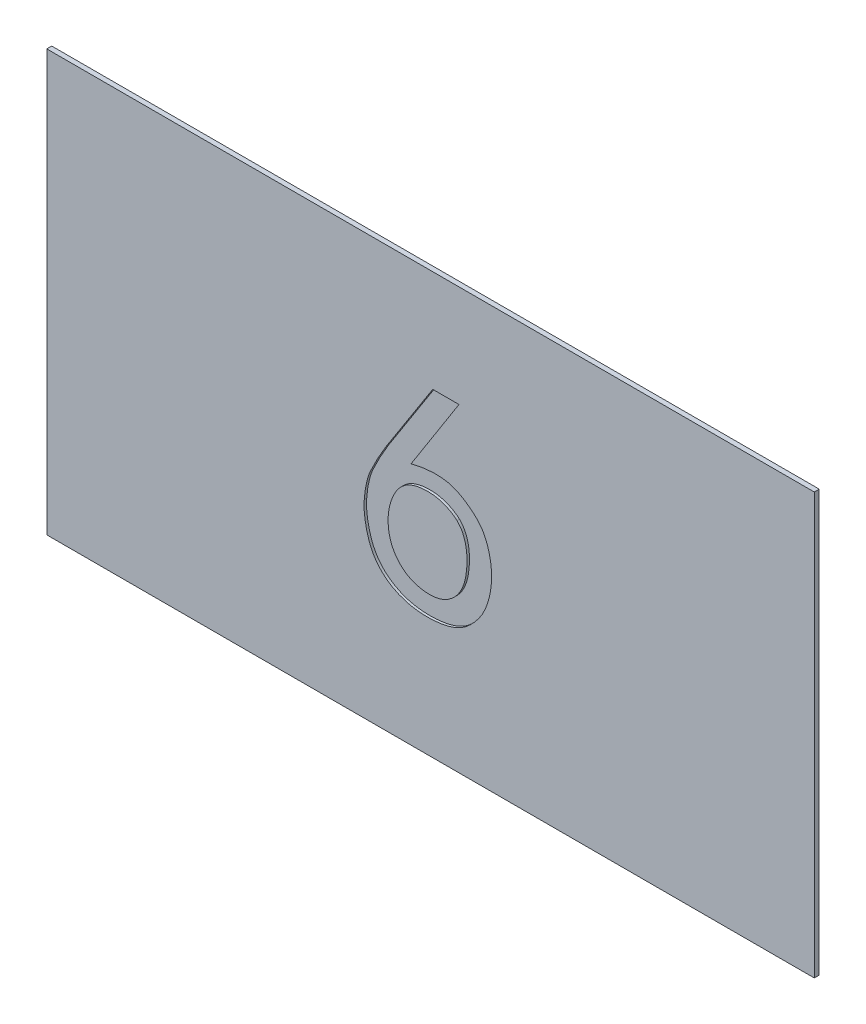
ISO-10303-21;
HEADER;
FILE_DESCRIPTION(('STEP AP214'),'2;1');
FILE_NAME('part.step','',(''),(''),'','','');
FILE_SCHEMA(('AUTOMOTIVE_DESIGN { 1 0 10303 214 1 1 1 1 }'));
ENDSEC;
DATA;
#1=APPLICATION_CONTEXT('core data for automotive mechanical design processes');
#2=APPLICATION_PROTOCOL_DEFINITION('international standard','automotive_design',2000,#1);
#3=PRODUCT_CONTEXT('',#1,'mechanical');
#4=PRODUCT('Part','Part','',(#3));
#5=PRODUCT_RELATED_PRODUCT_CATEGORY('part','',(#4));
#6=PRODUCT_DEFINITION_FORMATION('','',#4);
#7=PRODUCT_DEFINITION_CONTEXT('part definition',#1,'design');
#8=PRODUCT_DEFINITION('design','',#6,#7);
#9=PRODUCT_DEFINITION_SHAPE('','',#8);
#10=(LENGTH_UNIT() NAMED_UNIT(*) SI_UNIT(.MILLI.,.METRE.));
#11=(NAMED_UNIT(*) PLANE_ANGLE_UNIT() SI_UNIT($,.RADIAN.));
#12=(NAMED_UNIT(*) SI_UNIT($,.STERADIAN.) SOLID_ANGLE_UNIT());
#13=UNCERTAINTY_MEASURE_WITH_UNIT(LENGTH_MEASURE(1.E-05),#10,'distance_accuracy_value','');
#14=(GEOMETRIC_REPRESENTATION_CONTEXT(3) GLOBAL_UNCERTAINTY_ASSIGNED_CONTEXT((#13)) GLOBAL_UNIT_ASSIGNED_CONTEXT((#10,
#11,#12)) REPRESENTATION_CONTEXT('',''));
#15=CARTESIAN_POINT('',(0.,0.,0.));
#16=DIRECTION('',(0.,0.,1.));
#17=DIRECTION('',(1.,0.,0.));
#18=AXIS2_PLACEMENT_3D('',#15,#16,#17);
#19=CARTESIAN_POINT('',(0.,0.,0.2));
#20=DIRECTION('',(0.,0.,1.));
#21=DIRECTION('',(1.,0.,0.));
#22=AXIS2_PLACEMENT_3D('',#19,#20,#21);
#23=PLANE('',#22);
#24=CARTESIAN_POINT('',(1.06899208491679,0.284079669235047,0.2));
#25=CARTESIAN_POINT('',(1.08103603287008,0.272390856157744,0.2));
#26=CARTESIAN_POINT('',(1.09278831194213,0.260408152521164,0.2));
#27=CARTESIAN_POINT('',(1.1157209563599,0.235910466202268,0.2));
#28=CARTESIAN_POINT('',(1.12690141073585,0.223395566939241,0.2));
#29=CARTESIAN_POINT('',(1.15955248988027,0.185194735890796,0.2));
#30=CARTESIAN_POINT('',(1.18019363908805,0.158792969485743,0.2));
#31=CARTESIAN_POINT('',(1.21940109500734,0.104034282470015,0.2));
#32=CARTESIAN_POINT('',(1.23794047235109,0.0756581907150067,0.2));
#33=CARTESIAN_POINT('',(1.27258183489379,0.0174586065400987,0.2));
#34=CARTESIAN_POINT('',(1.2886843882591,-0.0123645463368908,0.2));
#35=CARTESIAN_POINT('',(1.31093894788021,-0.0580680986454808,0.2));
#36=CARTESIAN_POINT('',(1.31804995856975,-0.0734882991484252,0.2));
#37=CARTESIAN_POINT('',(1.33160698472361,-0.104618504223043,0.2));
#38=CARTESIAN_POINT('',(1.33805301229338,-0.12032850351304,0.2));
#39=CARTESIAN_POINT('',(1.35648009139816,-0.167836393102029,0.2));
#40=CARTESIAN_POINT('',(1.3675400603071,-0.199991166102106,0.2));
#41=CARTESIAN_POINT('',(1.3861575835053,-0.259308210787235,0.2));
#42=CARTESIAN_POINT('',(1.39399078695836,-0.286387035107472,0.2));
#43=CARTESIAN_POINT('',(1.40859224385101,-0.340832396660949,0.2));
#44=CARTESIAN_POINT('',(1.41536051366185,-0.368198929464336,0.2));
#45=CARTESIAN_POINT('',(1.42768000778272,-0.423197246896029,0.2));
#46=CARTESIAN_POINT('',(1.43323162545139,-0.450828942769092,0.2));
#47=CARTESIAN_POINT('',(1.44305537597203,-0.506316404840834,0.2));
#48=CARTESIAN_POINT('',(1.44732753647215,-0.534172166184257,0.2));
#49=CARTESIAN_POINT('',(1.45843735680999,-0.61803283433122,0.2));
#50=CARTESIAN_POINT('',(1.46355461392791,-0.674267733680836,0.2));
#51=CARTESIAN_POINT('',(1.47023025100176,-0.786947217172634,0.2));
#52=CARTESIAN_POINT('',(1.47178662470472,-0.843391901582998,0.2));
#53=CARTESIAN_POINT('',(1.47238435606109,-0.931226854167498,0.2));
#54=CARTESIAN_POINT('',(1.472235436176,-0.962616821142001,0.2));
#55=CARTESIAN_POINT('',(1.47115765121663,-1.02537233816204,0.2));
#56=CARTESIAN_POINT('',(1.47022910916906,-1.05673789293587,0.2));
#57=CARTESIAN_POINT('',(1.4674691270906,-1.11944803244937,0.2));
#58=CARTESIAN_POINT('',(1.46563718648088,-1.15079259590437,0.2));
#59=CARTESIAN_POINT('',(1.46099565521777,-1.21341734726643,0.2));
#60=CARTESIAN_POINT('',(1.45818575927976,-1.24469751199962,0.2));
#61=CARTESIAN_POINT('',(1.44822091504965,-1.33933767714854,0.2));
#62=CARTESIAN_POINT('',(1.4395717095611,-1.40255190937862,0.2));
#63=CARTESIAN_POINT('',(1.42343113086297,-1.49682683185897,0.2));
#64=CARTESIAN_POINT('',(1.41752177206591,-1.52816641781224,0.2));
#65=CARTESIAN_POINT('',(1.4045785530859,-1.59061460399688,0.2));
#66=CARTESIAN_POINT('',(1.39754471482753,-1.62172320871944,0.2));
#67=CARTESIAN_POINT('',(1.38221796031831,-1.68353991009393,0.2));
#68=CARTESIAN_POINT('',(1.37392863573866,-1.71424888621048,0.2));
#69=CARTESIAN_POINT('',(1.35589097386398,-1.77523243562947,0.2));
#70=CARTESIAN_POINT('',(1.34614266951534,-1.80550701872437,0.2));
#71=CARTESIAN_POINT('',(1.31458739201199,-1.89549863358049,0.2));
#72=CARTESIAN_POINT('',(1.29045838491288,-1.95443236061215,0.2));
#73=CARTESIAN_POINT('',(1.24428297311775,-2.05148595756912,0.2));
#74=CARTESIAN_POINT('',(1.22389909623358,-2.09040759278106,0.2));
#75=CARTESIAN_POINT('',(1.18011284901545,-2.16650044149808,0.2));
#76=CARTESIAN_POINT('',(1.15671205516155,-2.20367255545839,0.2));
#77=CARTESIAN_POINT('',(1.10666434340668,-2.27590428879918,0.2));
#78=CARTESIAN_POINT('',(1.08001029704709,-2.31095900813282,0.2));
#79=CARTESIAN_POINT('',(1.03771361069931,-2.36161176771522,0.2));
#80=CARTESIAN_POINT('',(1.02322113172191,-2.3781820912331,0.2));
#81=CARTESIAN_POINT('',(0.993488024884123,-2.41063963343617,0.2));
#82=CARTESIAN_POINT('',(0.978247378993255,-2.42652683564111,0.2));
#83=CARTESIAN_POINT('',(0.94707330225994,-2.45769688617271,0.2));
#84=CARTESIAN_POINT('',(0.931137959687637,-2.47297781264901,0.2));
#85=CARTESIAN_POINT('',(0.898724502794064,-2.5029550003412,0.2));
#86=CARTESIAN_POINT('',(0.882246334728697,-2.51765120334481,0.2));
#87=CARTESIAN_POINT('',(0.848754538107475,-2.54640276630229,0.2));
#88=CARTESIAN_POINT('',(0.831741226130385,-2.56045849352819,0.2));
#89=CARTESIAN_POINT('',(0.797082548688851,-2.5877668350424,0.2));
#90=CARTESIAN_POINT('',(0.779437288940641,-2.60101958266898,0.2));
#91=CARTESIAN_POINT('',(0.74352105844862,-2.6265432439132,0.2));
#92=CARTESIAN_POINT('',(0.725251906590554,-2.63881671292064,0.2));
#93=CARTESIAN_POINT('',(0.688097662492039,-2.66239430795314,0.2));
#94=CARTESIAN_POINT('',(0.669212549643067,-2.67369840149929,0.2));
#95=CARTESIAN_POINT('',(0.630864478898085,-2.69529290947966,0.2));
#96=CARTESIAN_POINT('',(0.611401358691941,-2.7055830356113,0.2));
#97=CARTESIAN_POINT('',(0.571981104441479,-2.7251707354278,0.2));
#98=CARTESIAN_POINT('',(0.552023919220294,-2.73446820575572,0.2));
#99=CARTESIAN_POINT('',(0.513513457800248,-2.75135372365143,0.2));
#100=CARTESIAN_POINT('',(0.494994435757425,-2.75902029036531,0.2));
#101=CARTESIAN_POINT('',(0.457659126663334,-2.77358988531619,0.2));
#102=CARTESIAN_POINT('',(0.438842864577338,-2.78049297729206,0.2));
#103=CARTESIAN_POINT('',(0.400898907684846,-2.79338454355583,0.2));
#104=CARTESIAN_POINT('',(0.381771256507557,-2.79937314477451,0.2));
#105=CARTESIAN_POINT('',(0.343209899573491,-2.81025425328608,0.2));
#106=CARTESIAN_POINT('',(0.323776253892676,-2.8151469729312,0.2));
#107=CARTESIAN_POINT('',(0.284652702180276,-2.82394271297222,0.2));
#108=CARTESIAN_POINT('',(0.264962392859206,-2.82784390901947,0.2));
#109=CARTESIAN_POINT('',(0.225438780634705,-2.83487441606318,0.2));
#110=CARTESIAN_POINT('',(0.205605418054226,-2.83800338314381,0.2));
#111=CARTESIAN_POINT('',(0.165848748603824,-2.84366683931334,0.2));
#112=CARTESIAN_POINT('',(0.145925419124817,-2.8462011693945,0.2));
#113=CARTESIAN_POINT('',(0.106004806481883,-2.85051253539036,0.2));
#114=CARTESIAN_POINT('',(0.0860075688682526,-2.85228997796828,0.2));
#115=CARTESIAN_POINT('',(0.0536058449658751,-2.85443527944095,0.2));
#116=CARTESIAN_POINT('',(0.0412196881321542,-2.85508223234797,0.2));
#117=CARTESIAN_POINT('',(0.0164332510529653,-2.855994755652,0.2));
#118=CARTESIAN_POINT('',(0.00403297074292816,-2.85626032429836,0.2));
#119=CARTESIAN_POINT('',(-0.0331840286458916,-2.85655327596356,0.2));
#120=CARTESIAN_POINT('',(-0.0580044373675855,-2.85607613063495,0.2));
#121=CARTESIAN_POINT('',(-0.10760842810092,-2.85420736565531,0.2));
#122=CARTESIAN_POINT('',(-0.132392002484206,-2.85281557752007,0.2));
#123=CARTESIAN_POINT('',(-0.181908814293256,-2.84939160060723,0.2));
#124=CARTESIAN_POINT('',(-0.206642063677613,-2.84735958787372,0.2));
#125=CARTESIAN_POINT('',(-0.256058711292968,-2.84234776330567,0.2));
#126=CARTESIAN_POINT('',(-0.280741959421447,-2.83936638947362,0.2));
#127=CARTESIAN_POINT('',(-0.3299350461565,-2.83220951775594,0.2));
#128=CARTESIAN_POINT('',(-0.354444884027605,-2.82803401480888,0.2));
#129=CARTESIAN_POINT('',(-0.403260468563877,-2.81874484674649,0.2));
#130=CARTESIAN_POINT('',(-0.427566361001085,-2.81363192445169,0.2));
#131=CARTESIAN_POINT('',(-0.476053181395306,-2.80282277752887,0.2));
#132=CARTESIAN_POINT('',(-0.500234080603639,-2.79712642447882,0.2));
#133=CARTESIAN_POINT('',(-0.544852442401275,-2.78578682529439,0.2));
#134=CARTESIAN_POINT('',(-0.565318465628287,-2.780258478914,0.2));
#135=CARTESIAN_POINT('',(-0.605969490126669,-2.76827143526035,0.2));
#136=CARTESIAN_POINT('',(-0.626154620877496,-2.76181318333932,0.2));
#137=CARTESIAN_POINT('',(-0.666178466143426,-2.74790042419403,0.2));
#138=CARTESIAN_POINT('',(-0.68601716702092,-2.740445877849,0.2));
#139=CARTESIAN_POINT('',(-0.725388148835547,-2.72475519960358,0.2));
#140=CARTESIAN_POINT('',(-0.744920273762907,-2.71651868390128,0.2));
#141=CARTESIAN_POINT('',(-0.802931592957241,-2.69094727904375,0.2));
#142=CARTESIAN_POINT('',(-0.84101456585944,-2.67268140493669,0.2));
#143=CARTESIAN_POINT('',(-0.915334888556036,-2.63271480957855,0.2));
#144=CARTESIAN_POINT('',(-0.951573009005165,-2.61101553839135,0.2));
#145=CARTESIAN_POINT('',(-1.01039871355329,-2.57210974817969,0.2));
#146=CARTESIAN_POINT('',(-1.03356441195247,-2.55576469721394,0.2));
#147=CARTESIAN_POINT('',(-1.07893235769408,-2.52178551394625,0.2));
#148=CARTESIAN_POINT('',(-1.10113456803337,-2.50415133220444,0.2));
#149=CARTESIAN_POINT('',(-1.14466602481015,-2.46760878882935,0.2));
#150=CARTESIAN_POINT('',(-1.16598998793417,-2.4486941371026,0.2));
#151=CARTESIAN_POINT('',(-1.20754094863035,-2.4097098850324,0.2));
#152=CARTESIAN_POINT('',(-1.22776830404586,-2.38964066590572,0.2));
#153=CARTESIAN_POINT('',(-1.24740553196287,-2.36900528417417,0.2));
#154=B_SPLINE_CURVE_WITH_KNOTS('',3,(#24,#25,#26,#27,#28,#29,#30,#31,#32,#33,#34,#35,#36,#37,
#38,#39,#40,#41,#42,#43,#44,#45,#46,#47,#48,#49,#50,#51,#52,#53,#54,#55,#56,#57,#58,#59,#60,#61,
#62,#63,#64,#65,#66,#67,#68,#69,#70,#71,#72,#73,#74,#75,#76,#77,#78,#79,#80,#81,#82,#83,#84,#85,
#86,#87,#88,#89,#90,#91,#92,#93,#94,#95,#96,#97,#98,#99,#100,#101,#102,#103,#104,#105,#106,#107,
#108,#109,#110,#111,#112,#113,#114,#115,#116,#117,#118,#119,#120,#121,#122,#123,#124,#125,#126,
#127,#128,#129,#130,#131,#132,#133,#134,#135,#136,#137,#138,#139,#140,#141,#142,#143,#144,#145,
#146,#147,#148,#149,#150,#151,#152,#153),.UNSPECIFIED.,.F.,.F.,(4,2,2,2,2,2,2,2,2,2,2,2,2,2,2,2,
2,2,2,2,2,2,2,2,2,2,2,2,2,2,2,2,2,2,2,2,2,2,2,2,2,2,2,2,2,2,2,2,2,2,2,2,2,2,2,2,2,2,2,2,2,2,2,2,
4),(0.,0.0503373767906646,0.100666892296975,0.201071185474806,0.302643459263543,
0.404192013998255,0.455121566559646,0.506050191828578,0.607977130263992,0.692526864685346,
0.77707529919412,0.861596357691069,0.94611558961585,1.11534799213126,1.28467571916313,
1.37884096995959,1.47296722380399,1.56714569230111,1.66135358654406,1.85260397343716,
1.94826417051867,2.04392250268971,2.13931217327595,2.23469969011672,2.42532476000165,
2.55701414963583,2.68863500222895,2.8205496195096,2.88657147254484,2.95259491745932,
3.01881320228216,3.08503806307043,3.15122445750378,3.21739983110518,3.2833964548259,
3.34939528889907,3.41541283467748,3.48143724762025,3.54155119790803,3.60166012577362,
3.66176070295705,3.7218496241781,3.78204831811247,3.84227377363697,3.90251531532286,
3.96272444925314,3.99992833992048,4.03713240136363,4.11157794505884,4.18603720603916,
4.26047601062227,4.33503792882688,4.4096001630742,4.48410356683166,4.55862340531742,
4.62220658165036,4.68575940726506,4.74931472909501,4.81290140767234,4.93947235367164,
5.06598998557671,5.15100209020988,5.23601745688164,5.32148593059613,5.40692634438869),.UNSPECIFIED.);
#155=CARTESIAN_POINT('',(1.06899208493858,0.284079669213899,0.2));
#156=VERTEX_POINT('',#155);
#157=CARTESIAN_POINT('',(-1.24740553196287,-2.36900528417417,0.2));
#158=VERTEX_POINT('',#157);
#159=EDGE_CURVE('E24',#156,#158,#154,.T.);
#160=ORIENTED_EDGE('',*,*,#159,.F.);
#161=CARTESIAN_POINT('',(-1.24740553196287,-2.36900528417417,0.2));
#162=CARTESIAN_POINT('',(-1.25892117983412,-2.35689766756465,0.2));
#163=CARTESIAN_POINT('',(-1.2702291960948,-2.34459427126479,0.2));
#164=CARTESIAN_POINT('',(-1.29243850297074,-2.3196332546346,0.2));
#165=CARTESIAN_POINT('',(-1.30333993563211,-2.30697576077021,0.2));
#166=CARTESIAN_POINT('',(-1.32475927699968,-2.28132744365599,0.2));
#167=CARTESIAN_POINT('',(-1.33527694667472,-2.26833642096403,0.2));
#168=CARTESIAN_POINT('',(-1.35593989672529,-2.24205600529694,0.2));
#169=CARTESIAN_POINT('',(-1.36608505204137,-2.22876651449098,0.2));
#170=CARTESIAN_POINT('',(-1.40280687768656,-2.17913410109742,0.2));
#171=CARTESIAN_POINT('',(-1.4281297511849,-2.1418451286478,0.2));
#172=CARTESIAN_POINT('',(-1.47549726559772,-2.0652462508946,0.2));
#173=CARTESIAN_POINT('',(-1.49754167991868,-2.02593620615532,0.2));
#174=CARTESIAN_POINT('',(-1.5383255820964,-1.94553928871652,0.2));
#175=CARTESIAN_POINT('',(-1.5570590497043,-1.90444934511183,0.2));
#176=CARTESIAN_POINT('',(-1.59090273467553,-1.82080482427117,0.2));
#177=CARTESIAN_POINT('',(-1.60601134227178,-1.77824960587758,0.2));
#178=CARTESIAN_POINT('',(-1.63728178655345,-1.68057040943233,0.2));
#179=CARTESIAN_POINT('',(-1.65261110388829,-1.62517791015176,0.2));
#180=CARTESIAN_POINT('',(-1.67776634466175,-1.51314560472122,0.2));
#181=CARTESIAN_POINT('',(-1.68759301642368,-1.45650596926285,0.2));
#182=CARTESIAN_POINT('',(-1.69868688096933,-1.37109950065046,0.2));
#183=CARTESIAN_POINT('',(-1.70177754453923,-1.3425470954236,0.2));
#184=CARTESIAN_POINT('',(-1.70690171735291,-1.28534681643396,0.2));
#185=CARTESIAN_POINT('',(-1.70893520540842,-1.25669894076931,0.2));
#186=CARTESIAN_POINT('',(-1.71355623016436,-1.17065592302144,0.2));
#187=CARTESIAN_POINT('',(-1.71466281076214,-1.11317371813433,0.2));
#188=CARTESIAN_POINT('',(-1.71266039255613,-0.996765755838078,0.2));
#189=CARTESIAN_POINT('',(-1.70943954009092,-0.937841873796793,0.2));
#190=CARTESIAN_POINT('',(-1.69844754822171,-0.820440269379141,0.2));
#191=CARTESIAN_POINT('',(-1.69067835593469,-0.761962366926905,0.2));
#192=CARTESIAN_POINT('',(-1.67046073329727,-0.645751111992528,0.2));
#193=CARTESIAN_POINT('',(-1.6580070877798,-0.588018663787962,0.2));
#194=CARTESIAN_POINT('',(-1.62855285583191,-0.473726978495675,0.2));
#195=CARTESIAN_POINT('',(-1.61155187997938,-0.417167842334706,0.2));
#196=CARTESIAN_POINT('',(-1.57662930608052,-0.31449142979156,0.2));
#197=CARTESIAN_POINT('',(-1.55930441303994,-0.268168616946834,0.2));
#198=CARTESIAN_POINT('',(-1.52181749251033,-0.176646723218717,0.2));
#199=CARTESIAN_POINT('',(-1.50165416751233,-0.131448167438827,0.2));
#200=CARTESIAN_POINT('',(-1.46913088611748,-0.0648245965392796,0.2));
#201=CARTESIAN_POINT('',(-1.4579218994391,-0.0428329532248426,0.2));
#202=CARTESIAN_POINT('',(-1.43473136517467,0.000742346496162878,0.2));
#203=CARTESIAN_POINT('',(-1.42274977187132,0.0223259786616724,0.2));
#204=CARTESIAN_POINT('',(-1.3979416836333,0.064972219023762,0.2));
#205=CARTESIAN_POINT('',(-1.38511617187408,0.0860353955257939,0.2));
#206=CARTESIAN_POINT('',(-1.35847661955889,0.127522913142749,0.2));
#207=CARTESIAN_POINT('',(-1.34466273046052,0.14794735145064,0.2));
#208=CARTESIAN_POINT('',(-1.31024610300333,0.195989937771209,0.2));
#209=CARTESIAN_POINT('',(-1.28912569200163,0.223244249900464,0.2));
#210=CARTESIAN_POINT('',(-1.25572006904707,0.26266829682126,0.2));
#211=CARTESIAN_POINT('',(-1.24429283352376,0.275571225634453,0.2));
#212=CARTESIAN_POINT('',(-1.22087507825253,0.300856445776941,0.2));
#213=CARTESIAN_POINT('',(-1.20888454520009,0.313238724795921,0.2));
#214=CARTESIAN_POINT('',(-1.18445087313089,0.337476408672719,0.2));
#215=CARTESIAN_POINT('',(-1.17200911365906,0.34933320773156,0.2));
#216=CARTESIAN_POINT('',(-1.14670868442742,0.372591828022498,0.2));
#217=CARTESIAN_POINT('',(-1.13384997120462,0.38399360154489,0.2));
#218=CARTESIAN_POINT('',(-1.09468994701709,0.41749919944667,0.2));
#219=CARTESIAN_POINT('',(-1.06778712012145,0.438920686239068,0.2));
#220=CARTESIAN_POINT('',(-1.02598612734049,0.469112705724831,0.2));
#221=CARTESIAN_POINT('',(-1.01179327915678,0.478863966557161,0.2));
#222=CARTESIAN_POINT('',(-0.982939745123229,0.49764975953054,0.2));
#223=CARTESIAN_POINT('',(-0.968279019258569,0.506684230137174,0.2));
#224=CARTESIAN_POINT('',(-0.923695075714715,0.532767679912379,0.2));
#225=CARTESIAN_POINT('',(-0.893170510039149,0.548796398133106,0.2));
#226=CARTESIAN_POINT('',(-0.830865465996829,0.578373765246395,0.2));
#227=CARTESIAN_POINT('',(-0.799082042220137,0.591916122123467,0.2));
#228=CARTESIAN_POINT('',(-0.750789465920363,0.610600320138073,0.2));
#229=CARTESIAN_POINT('',(-0.734588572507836,0.616556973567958,0.2));
#230=CARTESIAN_POINT('',(-0.702007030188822,0.627960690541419,0.2));
#231=CARTESIAN_POINT('',(-0.685626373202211,0.633407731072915,0.2));
#232=CARTESIAN_POINT('',(-0.645640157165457,0.645967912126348,0.2));
#233=CARTESIAN_POINT('',(-0.62194393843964,0.652795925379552,0.2));
#234=CARTESIAN_POINT('',(-0.574225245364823,0.665192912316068,0.2));
#235=CARTESIAN_POINT('',(-0.550202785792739,0.670761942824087,0.2));
#236=CARTESIAN_POINT('',(-0.501904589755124,0.680698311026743,0.2));
#237=CARTESIAN_POINT('',(-0.477628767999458,0.685065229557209,0.2));
#238=CARTESIAN_POINT('',(-0.428919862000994,0.692811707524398,0.2));
#239=CARTESIAN_POINT('',(-0.404486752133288,0.69619110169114,0.2));
#240=CARTESIAN_POINT('',(-0.331034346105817,0.705062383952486,0.2));
#241=CARTESIAN_POINT('',(-0.281858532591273,0.709288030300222,0.2));
#242=CARTESIAN_POINT('',(-0.183329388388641,0.714565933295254,0.2));
#243=CARTESIAN_POINT('',(-0.133976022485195,0.715617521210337,0.2));
#244=CARTESIAN_POINT('',(-0.058357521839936,0.714738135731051,0.2));
#245=CARTESIAN_POINT('',(-0.0320759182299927,0.713970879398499,0.2));
#246=CARTESIAN_POINT('',(0.0204381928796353,0.71144711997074,0.2));
#247=CARTESIAN_POINT('',(0.0466707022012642,0.709690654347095,0.2));
#248=CARTESIAN_POINT('',(0.125188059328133,0.702704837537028,0.2));
#249=CARTESIAN_POINT('',(0.177340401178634,0.695758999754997,0.2));
#250=CARTESIAN_POINT('',(0.254890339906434,0.681651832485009,0.2));
#251=CARTESIAN_POINT('',(0.280636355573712,0.67633213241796,0.2));
#252=CARTESIAN_POINT('',(0.331848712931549,0.664482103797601,0.2));
#253=CARTESIAN_POINT('',(0.357315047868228,0.657951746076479,0.2));
#254=CARTESIAN_POINT('',(0.433260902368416,0.636684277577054,0.2));
#255=CARTESIAN_POINT('',(0.48327953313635,0.620272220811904,0.2));
#256=CARTESIAN_POINT('',(0.572657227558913,0.586882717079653,0.2));
#257=CARTESIAN_POINT('',(0.612271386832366,0.570575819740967,0.2));
#258=CARTESIAN_POINT('',(0.690371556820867,0.535412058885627,0.2));
#259=CARTESIAN_POINT('',(0.728857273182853,0.516554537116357,0.2));
#260=CARTESIAN_POINT('',(0.804285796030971,0.476299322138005,0.2));
#261=CARTESIAN_POINT('',(0.841233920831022,0.454911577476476,0.2));
#262=CARTESIAN_POINT('',(0.913351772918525,0.409350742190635,0.2));
#263=CARTESIAN_POINT('',(0.948523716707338,0.385181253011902,0.2));
#264=CARTESIAN_POINT('',(0.997374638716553,0.34743009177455,0.2));
#265=CARTESIAN_POINT('',(1.01221444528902,0.335355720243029,0.2));
#266=CARTESIAN_POINT('',(1.03392047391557,0.316599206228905,0.2));
#267=CARTESIAN_POINT('',(1.04106497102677,0.310238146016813,0.2));
#268=CARTESIAN_POINT('',(1.05516847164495,0.297310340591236,0.2));
#269=CARTESIAN_POINT('',(1.0621274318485,0.290743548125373,0.2));
#270=CARTESIAN_POINT('',(1.06899208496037,0.284079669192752,0.2));
#271=B_SPLINE_CURVE_WITH_KNOTS('',3,(#161,#162,#163,#164,#165,#166,#167,#168,#169,#170,#171,
#172,#173,#174,#175,#176,#177,#178,#179,#180,#181,#182,#183,#184,#185,#186,#187,#188,#189,#190,
#191,#192,#193,#194,#195,#196,#197,#198,#199,#200,#201,#202,#203,#204,#205,#206,#207,#208,#209,
#210,#211,#212,#213,#214,#215,#216,#217,#218,#219,#220,#221,#222,#223,#224,#225,#226,#227,#228,
#229,#230,#231,#232,#233,#234,#235,#236,#237,#238,#239,#240,#241,#242,#243,#244,#245,#246,#247,
#248,#249,#250,#251,#252,#253,#254,#255,#256,#257,#258,#259,#260,#261,#262,#263,#264,#265,#266,
#267,#268,#269,#270),.UNSPECIFIED.,.F.,.F.,(4,2,2,2,2,2,2,2,2,2,2,2,2,2,2,2,2,2,2,2,2,2,2,2,2,2,
2,2,2,2,2,2,2,2,2,2,2,2,2,2,2,2,2,2,2,2,2,2,2,2,2,2,2,2,4),(0.,0.0501239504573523,
0.100230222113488,0.150367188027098,0.200520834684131,0.335567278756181,0.47062305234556,
0.605921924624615,0.741280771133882,0.913479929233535,1.08565566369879,1.17179790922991,
1.25794188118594,1.43026700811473,1.6071330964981,1.78392352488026,1.96091135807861,
2.13791435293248,2.28620459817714,2.4345628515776,2.50860028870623,2.58264211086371,
2.65659915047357,2.73054488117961,2.83385250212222,2.88554440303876,2.93723752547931,
2.98878409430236,3.04033605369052,3.14336581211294,3.19500585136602,3.24665031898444,
3.34994078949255,3.45348914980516,3.50526622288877,3.55704563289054,3.63099366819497,
3.70493836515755,3.77890881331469,3.8528916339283,4.00084678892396,4.14883311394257,
4.2276949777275,4.30655385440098,4.46412904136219,4.54297333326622,4.62181952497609,
4.77953544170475,4.90797309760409,5.03644396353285,5.16442551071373,5.29224318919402,
5.34960699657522,5.37830088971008,5.40700142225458),.UNSPECIFIED.);
#272=EDGE_CURVE('E118',#158,#156,#271,.T.);
#273=ORIENTED_EDGE('',*,*,#272,.F.);
#274=EDGE_LOOP('',(#160,#273));
#275=FACE_BOUND('',#274,.T.);
#276=ADVANCED_FACE('F17',(#275),#23,.T.);
#277=CARTESIAN_POINT('',(-1.24740553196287,-2.36900528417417,0.1));
#278=CARTESIAN_POINT('',(-1.24740553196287,-2.36900528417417,0.2));
#279=CARTESIAN_POINT('',(-1.21327511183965,-2.40488997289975,0.1));
#280=CARTESIAN_POINT('',(-1.21327511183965,-2.40488997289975,0.2));
#281=CARTESIAN_POINT('',(-1.14111701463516,-2.47345433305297,0.1));
#282=CARTESIAN_POINT('',(-1.14111701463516,-2.47345433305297,0.2));
#283=CARTESIAN_POINT('',(-1.02413096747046,-2.56523789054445,0.1));
#284=CARTESIAN_POINT('',(-1.02413096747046,-2.56523789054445,0.2));
#285=CARTESIAN_POINT('',(-0.897840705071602,-2.64509219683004,0.1));
#286=CARTESIAN_POINT('',(-0.897840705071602,-2.64509219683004,0.2));
#287=CARTESIAN_POINT('',(-0.762900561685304,-2.71071824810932,0.1));
#288=CARTESIAN_POINT('',(-0.762900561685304,-2.71071824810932,0.2));
#289=CARTESIAN_POINT('',(-0.620079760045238,-2.76701988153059,0.1));
#290=CARTESIAN_POINT('',(-0.620079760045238,-2.76701988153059,0.2));
#291=CARTESIAN_POINT('',(-0.467773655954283,-2.80598141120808,0.1));
#292=CARTESIAN_POINT('',(-0.467773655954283,-2.80598141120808,0.2));
#293=CARTESIAN_POINT('',(-0.307874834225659,-2.83844819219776,0.1));
#294=CARTESIAN_POINT('',(-0.307874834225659,-2.83844819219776,0.2));
#295=CARTESIAN_POINT('',(-0.141506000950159,-2.85377891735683,0.1));
#296=CARTESIAN_POINT('',(-0.141506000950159,-2.85377891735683,0.2));
#297=CARTESIAN_POINT('',(0.0259955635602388,-2.85943979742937,0.1));
#298=CARTESIAN_POINT('',(0.0259955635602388,-2.85943979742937,0.2));
#299=CARTESIAN_POINT('',(0.188898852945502,-2.842545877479,0.1));
#300=CARTESIAN_POINT('',(0.188898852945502,-2.842545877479,0.2));
#301=CARTESIAN_POINT('',(0.345334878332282,-2.81355514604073,0.1));
#302=CARTESIAN_POINT('',(0.345334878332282,-2.81355514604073,0.2));
#303=CARTESIAN_POINT('',(0.493817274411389,-2.76223075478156,0.1));
#304=CARTESIAN_POINT('',(0.493817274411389,-2.76223075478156,0.2));
#305=CARTESIAN_POINT('',(0.63573089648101,-2.69617562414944,0.1));
#306=CARTESIAN_POINT('',(0.63573089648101,-2.69617562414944,0.2));
#307=CARTESIAN_POINT('',(0.769933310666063,-2.61182860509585,0.1));
#308=CARTESIAN_POINT('',(0.769933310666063,-2.61182860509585,0.2));
#309=CARTESIAN_POINT('',(0.895243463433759,-2.50908430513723,0.1));
#310=CARTESIAN_POINT('',(0.895243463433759,-2.50908430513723,0.2));
#311=CARTESIAN_POINT('',(1.01450950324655,-2.39264648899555,0.1));
#312=CARTESIAN_POINT('',(1.01450950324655,-2.39264648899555,0.2));
#313=CARTESIAN_POINT('',(1.12249974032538,-2.25876242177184,0.1));
#314=CARTESIAN_POINT('',(1.12249974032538,-2.25876242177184,0.2));
#315=CARTESIAN_POINT('',(1.21663831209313,-2.10908444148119,0.1));
#316=CARTESIAN_POINT('',(1.21663831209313,-2.10908444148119,0.2));
#317=CARTESIAN_POINT('',(1.29685948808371,-1.94487817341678,0.1));
#318=CARTESIAN_POINT('',(1.29685948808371,-1.94487817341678,0.2));
#319=CARTESIAN_POINT('',(1.36176960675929,-1.76627986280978,0.1));
#320=CARTESIAN_POINT('',(1.36176960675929,-1.76627986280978,0.2));
#321=CARTESIAN_POINT('',(1.41066556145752,-1.57395839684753,0.1));
#322=CARTESIAN_POINT('',(1.41066556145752,-1.57395839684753,0.2));
#323=CARTESIAN_POINT('',(1.44635493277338,-1.36790574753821,0.1));
#324=CARTESIAN_POINT('',(1.44635493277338,-1.36790574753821,0.2));
#325=CARTESIAN_POINT('',(1.46856407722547,-1.14713015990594,0.1));
#326=CARTESIAN_POINT('',(1.46856407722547,-1.14713015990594,0.2));
#327=CARTESIAN_POINT('',(1.47442675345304,-0.917249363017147,0.1));
#328=CARTESIAN_POINT('',(1.47442675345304,-0.917249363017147,0.2));
#329=CARTESIAN_POINT('',(1.46750040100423,-0.688898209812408,0.1));
#330=CARTESIAN_POINT('',(1.46750040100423,-0.688898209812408,0.2));
#331=CARTESIAN_POINT('',(1.44130279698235,-0.473628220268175,0.1));
#332=CARTESIAN_POINT('',(1.44130279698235,-0.473628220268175,0.2));
#333=CARTESIAN_POINT('',(1.39434423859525,-0.277843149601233,0.1));
#334=CARTESIAN_POINT('',(1.39434423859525,-0.277843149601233,0.2));
#335=CARTESIAN_POINT('',(1.33411335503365,-0.0989361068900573,0.1));
#336=CARTESIAN_POINT('',(1.33411335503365,-0.0989361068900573,0.2));
#337=CARTESIAN_POINT('',(1.25193967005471,0.060179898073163,0.1));
#338=CARTESIAN_POINT('',(1.25193967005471,0.060179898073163,0.2));
#339=CARTESIAN_POINT('',(1.16158443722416,0.186646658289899,0.1));
#340=CARTESIAN_POINT('',(1.16158443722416,0.186646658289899,0.2));
#341=CARTESIAN_POINT('',(1.09679779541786,0.257091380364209,0.1));
#342=CARTESIAN_POINT('',(1.09679779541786,0.257091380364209,0.2));
#343=CARTESIAN_POINT('',(1.06899208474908,0.284079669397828,0.1));
#344=CARTESIAN_POINT('',(1.06899208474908,0.284079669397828,0.2));
#345=B_SPLINE_SURFACE_WITH_KNOTS('',3,1,((#277,#278),(#279,#280),(#281,#282),(#283,#284),(#285,
#286),(#287,#288),(#289,#290),(#291,#292),(#293,#294),(#295,#296),(#297,#298),(#299,#300),(#301,
#302),(#303,#304),(#305,#306),(#307,#308),(#309,#310),(#311,#312),(#313,#314),(#315,#316),(#317,
#318),(#319,#320),(#321,#322),(#323,#324),(#325,#326),(#327,#328),(#329,#330),(#331,#332),(#333,
#334),(#335,#336),(#337,#338),(#339,#340),(#341,#342),(#343,#344)),.UNSPECIFIED.,.F.,.F.,.F.,(4,
1,1,1,1,1,1,1,1,1,1,1,1,1,1,1,1,1,1,1,1,1,1,1,1,1,1,1,1,1,1,4),(2,2),(0.,0.0137396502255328,
0.0275769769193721,0.0412036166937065,0.0551173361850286,0.0691657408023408,0.0837233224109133,
0.0986831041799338,0.114397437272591,0.130035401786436,0.145105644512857,0.159755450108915,
0.17408857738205,0.18857144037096,0.203118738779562,0.217942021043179,0.233464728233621,
0.249299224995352,0.265554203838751,0.282434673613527,0.299921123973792,0.318192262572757,
0.337431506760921,0.357907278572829,0.379710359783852,0.401202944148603,0.421261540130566,
0.439763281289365,0.456994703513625,0.473522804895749,0.489256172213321,0.500000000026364),(0.,
1.),.UNSPECIFIED.);
#346=DIRECTION('',(0.,0.,1.));
#347=VECTOR('',#346,1.);
#348=CARTESIAN_POINT('',(-1.24740553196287,-2.36900528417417,0.15));
#349=LINE('',#348,#347);
#350=CARTESIAN_POINT('',(-1.24740553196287,-2.36900528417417,0.100000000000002));
#351=VERTEX_POINT('',#350);
#352=EDGE_CURVE('E113',#351,#158,#349,.T.);
#353=CARTESIAN_POINT('',(1.06899208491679,0.284079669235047,0.0999999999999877));
#354=CARTESIAN_POINT('',(1.08103603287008,0.272390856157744,0.100000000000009));
#355=CARTESIAN_POINT('',(1.09278831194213,0.260408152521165,0.100000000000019));
#356=CARTESIAN_POINT('',(1.1157209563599,0.235910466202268,0.100000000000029));
#357=CARTESIAN_POINT('',(1.12690141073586,0.223395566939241,0.100000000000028));
#358=CARTESIAN_POINT('',(1.15955248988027,0.185194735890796,0.100000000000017));
#359=CARTESIAN_POINT('',(1.18019363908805,0.158792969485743,0.1));
#360=CARTESIAN_POINT('',(1.21940109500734,0.104034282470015,0.0999999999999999));
#361=CARTESIAN_POINT('',(1.23794047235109,0.075658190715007,0.100000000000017));
#362=CARTESIAN_POINT('',(1.27258183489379,0.0174586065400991,0.100000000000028));
#363=CARTESIAN_POINT('',(1.2886843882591,-0.0123645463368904,0.100000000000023));
#364=CARTESIAN_POINT('',(1.31093894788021,-0.0580680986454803,0.100000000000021));
#365=CARTESIAN_POINT('',(1.31804995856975,-0.0734882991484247,0.100000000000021));
#366=CARTESIAN_POINT('',(1.33160698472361,-0.104618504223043,0.100000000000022));
#367=CARTESIAN_POINT('',(1.33805301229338,-0.120328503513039,0.100000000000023));
#368=CARTESIAN_POINT('',(1.35648009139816,-0.167836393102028,0.100000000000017));
#369=CARTESIAN_POINT('',(1.3675400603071,-0.199991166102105,0.099999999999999));
#370=CARTESIAN_POINT('',(1.3861575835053,-0.259308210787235,0.100000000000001));
#371=CARTESIAN_POINT('',(1.39399078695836,-0.286387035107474,0.100000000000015));
#372=CARTESIAN_POINT('',(1.40859224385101,-0.340832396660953,0.100000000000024));
#373=CARTESIAN_POINT('',(1.41536051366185,-0.368198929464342,0.10000000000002));
#374=CARTESIAN_POINT('',(1.42768000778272,-0.423197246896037,0.100000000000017));
#375=CARTESIAN_POINT('',(1.4332316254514,-0.450828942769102,0.100000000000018));
#376=CARTESIAN_POINT('',(1.44305537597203,-0.506316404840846,0.100000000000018));
#377=CARTESIAN_POINT('',(1.44732753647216,-0.534172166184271,0.100000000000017));
#378=CARTESIAN_POINT('',(1.45843735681,-0.618032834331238,0.100000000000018));
#379=CARTESIAN_POINT('',(1.46355461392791,-0.674267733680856,0.100000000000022));
#380=CARTESIAN_POINT('',(1.47023025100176,-0.78694721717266,0.100000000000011));
#381=CARTESIAN_POINT('',(1.47178662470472,-0.843391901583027,0.0999999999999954));
#382=CARTESIAN_POINT('',(1.47238435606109,-0.93122685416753,0.100000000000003));
#383=CARTESIAN_POINT('',(1.472235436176,-0.962616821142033,0.100000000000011));
#384=CARTESIAN_POINT('',(1.47115765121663,-1.02537233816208,0.100000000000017));
#385=CARTESIAN_POINT('',(1.47022910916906,-1.0567378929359,0.100000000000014));
#386=CARTESIAN_POINT('',(1.46746912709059,-1.1194480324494,0.100000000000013));
#387=CARTESIAN_POINT('',(1.46563718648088,-1.1507925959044,0.100000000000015));
#388=CARTESIAN_POINT('',(1.46099565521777,-1.21341734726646,0.10000000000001));
#389=CARTESIAN_POINT('',(1.45818575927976,-1.24469751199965,0.100000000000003));
#390=CARTESIAN_POINT('',(1.44822091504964,-1.33933767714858,0.0999999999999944));
#391=CARTESIAN_POINT('',(1.43957170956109,-1.40255190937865,0.100000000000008));
#392=CARTESIAN_POINT('',(1.42343113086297,-1.49682683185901,0.100000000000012));
#393=CARTESIAN_POINT('',(1.4175217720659,-1.52816641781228,0.100000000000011));
#394=CARTESIAN_POINT('',(1.40457855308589,-1.59061460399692,0.100000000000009));
#395=CARTESIAN_POINT('',(1.39754471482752,-1.62172320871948,0.100000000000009));
#396=CARTESIAN_POINT('',(1.3822179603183,-1.68353991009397,0.100000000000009));
#397=CARTESIAN_POINT('',(1.37392863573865,-1.71424888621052,0.100000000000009));
#398=CARTESIAN_POINT('',(1.35589097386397,-1.77523243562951,0.100000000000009));
#399=CARTESIAN_POINT('',(1.34614266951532,-1.80550701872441,0.100000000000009));
#400=CARTESIAN_POINT('',(1.31458739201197,-1.89549863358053,0.100000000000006));
#401=CARTESIAN_POINT('',(1.29045838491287,-1.95443236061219,0.0999999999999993));
#402=CARTESIAN_POINT('',(1.24428297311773,-2.05148595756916,0.1));
#403=CARTESIAN_POINT('',(1.22389909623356,-2.0904075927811,0.100000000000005));
#404=CARTESIAN_POINT('',(1.18011284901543,-2.16650044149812,0.100000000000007));
#405=CARTESIAN_POINT('',(1.15671205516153,-2.20367255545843,0.100000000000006));
#406=CARTESIAN_POINT('',(1.10666434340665,-2.27590428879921,0.100000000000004));
#407=CARTESIAN_POINT('',(1.08001029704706,-2.31095900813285,0.100000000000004));
#408=CARTESIAN_POINT('',(1.03771361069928,-2.36161176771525,0.100000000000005));
#409=CARTESIAN_POINT('',(1.02322113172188,-2.37818209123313,0.100000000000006));
#410=CARTESIAN_POINT('',(0.993488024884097,-2.4106396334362,0.100000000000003));
#411=CARTESIAN_POINT('',(0.978247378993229,-2.42652683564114,0.1));
#412=CARTESIAN_POINT('',(0.947073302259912,-2.45769688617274,0.1));
#413=CARTESIAN_POINT('',(0.93113795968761,-2.47297781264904,0.100000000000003));
#414=CARTESIAN_POINT('',(0.898724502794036,-2.50295500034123,0.100000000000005));
#415=CARTESIAN_POINT('',(0.882246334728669,-2.51765120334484,0.100000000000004));
#416=CARTESIAN_POINT('',(0.848754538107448,-2.54640276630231,0.100000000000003));
#417=CARTESIAN_POINT('',(0.831741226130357,-2.56045849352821,0.100000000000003));
#418=CARTESIAN_POINT('',(0.797082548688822,-2.58776683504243,0.100000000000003));
#419=CARTESIAN_POINT('',(0.779437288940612,-2.601019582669,0.100000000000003));
#420=CARTESIAN_POINT('',(0.743521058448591,-2.62654324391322,0.100000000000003));
#421=CARTESIAN_POINT('',(0.725251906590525,-2.63881671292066,0.100000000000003));
#422=CARTESIAN_POINT('',(0.688097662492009,-2.66239430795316,0.100000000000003));
#423=CARTESIAN_POINT('',(0.669212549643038,-2.67369840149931,0.100000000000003));
#424=CARTESIAN_POINT('',(0.630864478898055,-2.69529290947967,0.100000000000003));
#425=CARTESIAN_POINT('',(0.611401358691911,-2.70558303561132,0.100000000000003));
#426=CARTESIAN_POINT('',(0.57198110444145,-2.72517073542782,0.100000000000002));
#427=CARTESIAN_POINT('',(0.552023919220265,-2.73446820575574,0.0999999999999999));
#428=CARTESIAN_POINT('',(0.513513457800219,-2.75135372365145,0.1));
#429=CARTESIAN_POINT('',(0.494994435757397,-2.75902029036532,0.100000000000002));
#430=CARTESIAN_POINT('',(0.457659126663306,-2.7735898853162,0.100000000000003));
#431=CARTESIAN_POINT('',(0.438842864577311,-2.78049297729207,0.100000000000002));
#432=CARTESIAN_POINT('',(0.400898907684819,-2.79338454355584,0.100000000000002));
#433=CARTESIAN_POINT('',(0.38177125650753,-2.79937314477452,0.100000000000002));
#434=CARTESIAN_POINT('',(0.343209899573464,-2.81025425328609,0.100000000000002));
#435=CARTESIAN_POINT('',(0.32377625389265,-2.81514697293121,0.100000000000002));
#436=CARTESIAN_POINT('',(0.284652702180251,-2.82394271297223,0.100000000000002));
#437=CARTESIAN_POINT('',(0.264962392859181,-2.82784390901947,0.100000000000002));
#438=CARTESIAN_POINT('',(0.225438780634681,-2.83487441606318,0.100000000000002));
#439=CARTESIAN_POINT('',(0.205605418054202,-2.83800338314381,0.100000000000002));
#440=CARTESIAN_POINT('',(0.165848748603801,-2.84366683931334,0.100000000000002));
#441=CARTESIAN_POINT('',(0.145925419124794,-2.8462011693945,0.100000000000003));
#442=CARTESIAN_POINT('',(0.106004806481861,-2.85051253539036,0.100000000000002));
#443=CARTESIAN_POINT('',(0.086007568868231,-2.85228997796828,0.0999999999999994));
#444=CARTESIAN_POINT('',(0.0536058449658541,-2.85443527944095,0.1));
#445=CARTESIAN_POINT('',(0.0412196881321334,-2.85508223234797,0.100000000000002));
#446=CARTESIAN_POINT('',(0.016433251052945,-2.855994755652,0.100000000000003));
#447=CARTESIAN_POINT('',(0.0040329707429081,-2.85626032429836,0.100000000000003));
#448=CARTESIAN_POINT('',(-0.0331840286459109,-2.85655327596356,0.100000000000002));
#449=CARTESIAN_POINT('',(-0.0580044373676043,-2.85607613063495,0.100000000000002));
#450=CARTESIAN_POINT('',(-0.107608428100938,-2.85420736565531,0.100000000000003));
#451=CARTESIAN_POINT('',(-0.132392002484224,-2.85281557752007,0.100000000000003));
#452=CARTESIAN_POINT('',(-0.181908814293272,-2.84939160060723,0.100000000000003));
#453=CARTESIAN_POINT('',(-0.206642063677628,-2.84735958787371,0.100000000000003));
#454=CARTESIAN_POINT('',(-0.256058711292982,-2.84234776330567,0.100000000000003));
#455=CARTESIAN_POINT('',(-0.280741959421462,-2.83936638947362,0.100000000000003));
#456=CARTESIAN_POINT('',(-0.329935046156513,-2.83220951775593,0.100000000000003));
#457=CARTESIAN_POINT('',(-0.354444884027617,-2.82803401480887,0.100000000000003));
#458=CARTESIAN_POINT('',(-0.403260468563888,-2.81874484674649,0.100000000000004));
#459=CARTESIAN_POINT('',(-0.427566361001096,-2.81363192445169,0.100000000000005));
#460=CARTESIAN_POINT('',(-0.476053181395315,-2.80282277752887,0.100000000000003));
#461=CARTESIAN_POINT('',(-0.500234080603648,-2.79712642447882,0.0999999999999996));
#462=CARTESIAN_POINT('',(-0.544852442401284,-2.78578682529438,0.1));
#463=CARTESIAN_POINT('',(-0.565318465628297,-2.78025847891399,0.100000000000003));
#464=CARTESIAN_POINT('',(-0.605969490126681,-2.76827143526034,0.100000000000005));
#465=CARTESIAN_POINT('',(-0.626154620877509,-2.76181318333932,0.100000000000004));
#466=CARTESIAN_POINT('',(-0.66617846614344,-2.74790042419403,0.100000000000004));
#467=CARTESIAN_POINT('',(-0.686017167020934,-2.740445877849,0.100000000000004));
#468=CARTESIAN_POINT('',(-0.725388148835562,-2.72475519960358,0.100000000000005));
#469=CARTESIAN_POINT('',(-0.744920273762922,-2.71651868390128,0.100000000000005));
#470=CARTESIAN_POINT('',(-0.802931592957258,-2.69094727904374,0.100000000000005));
#471=CARTESIAN_POINT('',(-0.841014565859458,-2.67268140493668,0.100000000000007));
#472=CARTESIAN_POINT('',(-0.915334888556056,-2.63271480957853,0.100000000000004));
#473=CARTESIAN_POINT('',(-0.951573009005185,-2.61101553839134,0.0999999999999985));
#474=CARTESIAN_POINT('',(-1.01039871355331,-2.57210974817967,0.100000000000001));
#475=CARTESIAN_POINT('',(-1.03356441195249,-2.55576469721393,0.100000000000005));
#476=CARTESIAN_POINT('',(-1.07893235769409,-2.52178551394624,0.100000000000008));
#477=CARTESIAN_POINT('',(-1.10113456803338,-2.50415133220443,0.100000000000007));
#478=CARTESIAN_POINT('',(-1.14466602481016,-2.46760878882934,0.100000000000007));
#479=CARTESIAN_POINT('',(-1.16598998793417,-2.44869413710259,0.100000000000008));
#480=CARTESIAN_POINT('',(-1.20754094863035,-2.4097098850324,0.100000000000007));
#481=CARTESIAN_POINT('',(-1.22776830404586,-2.38964066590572,0.100000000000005));
#482=CARTESIAN_POINT('',(-1.24740553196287,-2.36900528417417,0.1));
#483=B_SPLINE_CURVE_WITH_KNOTS('',3,(#353,#354,#355,#356,#357,#358,#359,#360,#361,#362,#363,
#364,#365,#366,#367,#368,#369,#370,#371,#372,#373,#374,#375,#376,#377,#378,#379,#380,#381,#382,
#383,#384,#385,#386,#387,#388,#389,#390,#391,#392,#393,#394,#395,#396,#397,#398,#399,#400,#401,
#402,#403,#404,#405,#406,#407,#408,#409,#410,#411,#412,#413,#414,#415,#416,#417,#418,#419,#420,
#421,#422,#423,#424,#425,#426,#427,#428,#429,#430,#431,#432,#433,#434,#435,#436,#437,#438,#439,
#440,#441,#442,#443,#444,#445,#446,#447,#448,#449,#450,#451,#452,#453,#454,#455,#456,#457,#458,
#459,#460,#461,#462,#463,#464,#465,#466,#467,#468,#469,#470,#471,#472,#473,#474,#475,#476,#477,
#478,#479,#480,#481,#482),.UNSPECIFIED.,.F.,.F.,(4,2,2,2,2,2,2,2,2,2,2,2,2,2,2,2,2,2,2,2,2,2,2,
2,2,2,2,2,2,2,2,2,2,2,2,2,2,2,2,2,2,2,2,2,2,2,2,2,2,2,2,2,2,2,2,2,2,2,2,2,2,2,2,2,4),(0.,
0.0503373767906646,0.100666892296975,0.201071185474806,0.302643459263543,0.404192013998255,
0.455121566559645,0.506050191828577,0.607977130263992,0.69252686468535,0.777075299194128,
0.86159635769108,0.946115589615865,1.11534799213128,1.28467571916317,1.37884096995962,
1.47296722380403,1.56714569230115,1.6613535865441,1.8526039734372,1.94826417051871,
2.04392250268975,2.139312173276,2.23469969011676,2.42532476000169,2.55701414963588,
2.68863500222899,2.82054961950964,2.88657147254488,2.95259491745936,3.0188132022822,
3.08503806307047,3.15122445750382,3.21739983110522,3.28339645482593,3.3493952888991,
3.41541283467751,3.48143724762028,3.54155119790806,3.60166012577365,3.66176070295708,
3.72184962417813,3.7820483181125,3.84227377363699,3.90251531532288,3.96272444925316,
3.9999283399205,4.03713240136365,4.11157794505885,4.18603720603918,4.26047601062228,
4.3350379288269,4.40960016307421,4.48410356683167,4.55862340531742,4.62220658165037,
4.68575940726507,4.74931472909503,4.81290140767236,4.93947235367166,5.06598998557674,
5.1510020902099,5.23601745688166,5.32148593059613,5.40692634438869),.UNSPECIFIED.);
#484=CARTESIAN_POINT('',(1.06899208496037,0.284079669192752,0.100000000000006));
#485=VERTEX_POINT('',#484);
#486=EDGE_CURVE('E122',#485,#351,#483,.T.);
#487=DIRECTION('',(0.,0.,-1.));
#488=VECTOR('',#487,1.);
#489=CARTESIAN_POINT('',(1.06899208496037,0.284079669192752,0.15));
#490=LINE('',#489,#488);
#491=EDGE_CURVE('E115',#156,#485,#490,.T.);
#492=ORIENTED_EDGE('',*,*,#159,.T.);
#493=ORIENTED_EDGE('',*,*,#352,.F.);
#494=ORIENTED_EDGE('',*,*,#486,.F.);
#495=ORIENTED_EDGE('',*,*,#491,.F.);
#496=EDGE_LOOP('',(#492,#493,#494,#495));
#497=FACE_BOUND('',#496,.T.);
#498=ADVANCED_FACE('F111',(#497),#345,.T.);
#499=CARTESIAN_POINT('',(1.06899208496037,0.284079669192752,0.1));
#500=CARTESIAN_POINT('',(1.06899208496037,0.284079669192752,0.2));
#501=CARTESIAN_POINT('',(1.05633193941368,0.296367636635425,0.1));
#502=CARTESIAN_POINT('',(1.05633193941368,0.296367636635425,0.2));
#503=CARTESIAN_POINT('',(1.00205602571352,0.346386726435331,0.1));
#504=CARTESIAN_POINT('',(1.00205602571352,0.346386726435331,0.2));
#505=CARTESIAN_POINT('',(0.896357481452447,0.423473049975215,0.1));
#506=CARTESIAN_POINT('',(0.896357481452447,0.423473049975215,0.2));
#507=CARTESIAN_POINT('',(0.750722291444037,0.507566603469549,0.0999999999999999));
#508=CARTESIAN_POINT('',(0.750722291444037,0.507566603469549,0.2));
#509=CARTESIAN_POINT('',(0.59964997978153,0.577847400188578,0.1));
#510=CARTESIAN_POINT('',(0.59964997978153,0.577847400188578,0.2));
#511=CARTESIAN_POINT('',(0.444978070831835,0.634702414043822,0.1));
#512=CARTESIAN_POINT('',(0.444978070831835,0.634702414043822,0.2));
#513=CARTESIAN_POINT('',(0.285731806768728,0.677843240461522,0.1));
#514=CARTESIAN_POINT('',(0.285731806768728,0.677843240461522,0.2));
#515=CARTESIAN_POINT('',(0.121024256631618,0.705178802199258,0.1));
#516=CARTESIAN_POINT('',(0.121024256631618,0.705178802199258,0.2));
#517=CARTESIAN_POINT('',(-0.0481553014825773,0.716527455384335,0.1));
#518=CARTESIAN_POINT('',(-0.0481553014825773,0.716527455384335,0.2));
#519=CARTESIAN_POINT('',(-0.221105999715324,0.71471082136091,0.0999999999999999));
#520=CARTESIAN_POINT('',(-0.221105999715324,0.71471082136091,0.2));
#521=CARTESIAN_POINT('',(-0.395311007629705,0.699699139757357,0.1));
#522=CARTESIAN_POINT('',(-0.395311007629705,0.699699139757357,0.2));
#523=CARTESIAN_POINT('',(-0.566226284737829,0.670521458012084,0.0999999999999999));
#524=CARTESIAN_POINT('',(-0.566226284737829,0.670521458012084,0.2));
#525=CARTESIAN_POINT('',(-0.726713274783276,0.622137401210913,0.1));
#526=CARTESIAN_POINT('',(-0.726713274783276,0.622137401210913,0.2));
#527=CARTESIAN_POINT('',(-0.876151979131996,0.56047868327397,0.1));
#528=CARTESIAN_POINT('',(-0.876151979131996,0.56047868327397,0.2));
#529=CARTESIAN_POINT('',(-1.01354305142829,0.482303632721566,0.1));
#530=CARTESIAN_POINT('',(-1.01354305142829,0.482303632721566,0.2));
#531=CARTESIAN_POINT('',(-1.13650746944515,0.385090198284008,0.1));
#532=CARTESIAN_POINT('',(-1.13650746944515,0.385090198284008,0.2));
#533=CARTESIAN_POINT('',(-1.24947198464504,0.275085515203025,0.1));
#534=CARTESIAN_POINT('',(-1.24947198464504,0.275085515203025,0.2));
#535=CARTESIAN_POINT('',(-1.34842899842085,0.14763097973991,0.1));
#536=CARTESIAN_POINT('',(-1.34842899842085,0.14763097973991,0.2));
#537=CARTESIAN_POINT('',(-1.46278434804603,-0.0409461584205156,0.1));
#538=CARTESIAN_POINT('',(-1.46278434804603,-0.0409461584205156,0.2));
#539=CARTESIAN_POINT('',(-1.5759521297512,-0.293073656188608,0.1));
#540=CARTESIAN_POINT('',(-1.5759521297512,-0.293073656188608,0.2));
#541=CARTESIAN_POINT('',(-1.67022628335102,-0.608825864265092,0.1));
#542=CARTESIAN_POINT('',(-1.67022628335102,-0.608825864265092,0.2));
#543=CARTESIAN_POINT('',(-1.71623738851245,-0.93387387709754,0.1));
#544=CARTESIAN_POINT('',(-1.71623738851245,-0.93387387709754,0.2));
#545=CARTESIAN_POINT('',(-1.71569824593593,-1.20818059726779,0.1));
#546=CARTESIAN_POINT('',(-1.71569824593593,-1.20818059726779,0.2));
#547=CARTESIAN_POINT('',(-1.69380750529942,-1.42467509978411,0.1));
#548=CARTESIAN_POINT('',(-1.69380750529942,-1.42467509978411,0.2));
#549=CARTESIAN_POINT('',(-1.6648153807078,-1.58120622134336,0.1));
#550=CARTESIAN_POINT('',(-1.6648153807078,-1.58120622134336,0.2));
#551=CARTESIAN_POINT('',(-1.62334228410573,-1.72994712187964,0.0999999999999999));
#552=CARTESIAN_POINT('',(-1.62334228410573,-1.72994712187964,0.2));
#553=CARTESIAN_POINT('',(-1.57253119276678,-1.87256669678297,0.1));
#554=CARTESIAN_POINT('',(-1.57253119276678,-1.87256669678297,0.2));
#555=CARTESIAN_POINT('',(-1.50898581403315,-2.00798398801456,0.1));
#556=CARTESIAN_POINT('',(-1.50898581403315,-2.00798398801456,0.2));
#557=CARTESIAN_POINT('',(-1.43360700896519,-2.1366156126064,0.1));
#558=CARTESIAN_POINT('',(-1.43360700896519,-2.1366156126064,0.2));
#559=CARTESIAN_POINT('',(-1.34645968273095,-2.25753963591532,0.1));
#560=CARTESIAN_POINT('',(-1.34645968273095,-2.25753963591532,0.2));
#561=CARTESIAN_POINT('',(-1.28161702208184,-2.33303535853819,0.1));
#562=CARTESIAN_POINT('',(-1.28161702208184,-2.33303535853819,0.2));
#563=CARTESIAN_POINT('',(-1.24740553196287,-2.36900528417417,0.1));
#564=CARTESIAN_POINT('',(-1.24740553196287,-2.36900528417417,0.2));
#565=B_SPLINE_SURFACE_WITH_KNOTS('',3,1,((#499,#500),(#501,#502),(#503,#504),(#505,#506),(#507,
#508),(#509,#510),(#511,#512),(#513,#514),(#515,#516),(#517,#518),(#519,#520),(#521,#522),(#523,
#524),(#525,#526),(#527,#528),(#529,#530),(#531,#532),(#533,#534),(#535,#536),(#537,#538),(#539,
#540),(#541,#542),(#543,#544),(#545,#546),(#547,#548),(#549,#550),(#551,#552),(#553,#554),(#555,
#556),(#557,#558),(#559,#560),(#561,#562),(#563,#564)),.UNSPECIFIED.,.F.,.F.,.F.,(4,1,1,1,1,1,1,
1,1,1,1,1,1,1,1,1,1,1,1,1,1,1,1,1,1,1,1,1,1,1,4),(2,2),(0.499999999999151,0.504891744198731,
0.520463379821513,0.536173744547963,0.55150568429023,0.566644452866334,0.581853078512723,
0.597223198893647,0.612897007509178,0.628848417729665,0.64517687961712,0.661378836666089,
0.676868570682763,0.691592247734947,0.706166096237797,0.720571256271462,0.734977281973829,
0.74982578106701,0.765210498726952,0.796095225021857,0.826227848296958,0.856379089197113,
0.886859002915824,0.902102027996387,0.916722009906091,0.930974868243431,0.944912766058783,
0.958689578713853,0.972421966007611,0.986227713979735,1.000000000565),(0.,1.),.UNSPECIFIED.);
#566=CARTESIAN_POINT('',(-1.24740553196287,-2.36900528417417,0.099999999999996));
#567=CARTESIAN_POINT('',(-1.25892117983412,-2.35689766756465,0.100000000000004));
#568=CARTESIAN_POINT('',(-1.2702291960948,-2.34459427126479,0.100000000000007));
#569=CARTESIAN_POINT('',(-1.29243850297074,-2.3196332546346,0.100000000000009));
#570=CARTESIAN_POINT('',(-1.30333993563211,-2.30697576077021,0.100000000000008));
#571=CARTESIAN_POINT('',(-1.32475927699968,-2.28132744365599,0.100000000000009));
#572=CARTESIAN_POINT('',(-1.33527694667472,-2.26833642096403,0.100000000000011));
#573=CARTESIAN_POINT('',(-1.35593989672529,-2.24205600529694,0.100000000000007));
#574=CARTESIAN_POINT('',(-1.36608505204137,-2.22876651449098,0.100000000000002));
#575=CARTESIAN_POINT('',(-1.40280687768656,-2.17913410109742,0.0999999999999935));
#576=CARTESIAN_POINT('',(-1.42812975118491,-2.1418451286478,0.100000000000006));
#577=CARTESIAN_POINT('',(-1.47549726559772,-2.0652462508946,0.100000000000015));
#578=CARTESIAN_POINT('',(-1.49754167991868,-2.02593620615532,0.100000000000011));
#579=CARTESIAN_POINT('',(-1.5383255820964,-1.94553928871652,0.100000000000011));
#580=CARTESIAN_POINT('',(-1.5570590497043,-1.90444934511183,0.100000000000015));
#581=CARTESIAN_POINT('',(-1.59090273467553,-1.82080482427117,0.10000000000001));
#582=CARTESIAN_POINT('',(-1.60601134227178,-1.77824960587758,0.100000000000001));
#583=CARTESIAN_POINT('',(-1.63728178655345,-1.68057040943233,0.0999999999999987));
#584=CARTESIAN_POINT('',(-1.65261110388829,-1.62517791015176,0.10000000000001));
#585=CARTESIAN_POINT('',(-1.67776634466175,-1.51314560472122,0.100000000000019));
#586=CARTESIAN_POINT('',(-1.68759301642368,-1.45650596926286,0.100000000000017));
#587=CARTESIAN_POINT('',(-1.69868688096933,-1.37109950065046,0.100000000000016));
#588=CARTESIAN_POINT('',(-1.70177754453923,-1.3425470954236,0.100000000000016));
#589=CARTESIAN_POINT('',(-1.70690171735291,-1.28534681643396,0.100000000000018));
#590=CARTESIAN_POINT('',(-1.70893520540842,-1.25669894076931,0.100000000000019));
#591=CARTESIAN_POINT('',(-1.71355623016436,-1.17065592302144,0.100000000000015));
#592=CARTESIAN_POINT('',(-1.71466281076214,-1.11317371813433,0.1));
#593=CARTESIAN_POINT('',(-1.71266039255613,-0.996765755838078,0.0999999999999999));
#594=CARTESIAN_POINT('',(-1.70943954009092,-0.937841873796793,0.100000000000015));
#595=CARTESIAN_POINT('',(-1.69844754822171,-0.820440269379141,0.100000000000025));
#596=CARTESIAN_POINT('',(-1.69067835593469,-0.761962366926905,0.100000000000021));
#597=CARTESIAN_POINT('',(-1.67046073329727,-0.645751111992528,0.100000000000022));
#598=CARTESIAN_POINT('',(-1.6580070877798,-0.588018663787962,0.100000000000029));
#599=CARTESIAN_POINT('',(-1.62855285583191,-0.473726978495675,0.100000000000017));
#600=CARTESIAN_POINT('',(-1.61155187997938,-0.417167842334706,0.0999999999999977));
#601=CARTESIAN_POINT('',(-1.57662930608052,-0.31449142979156,0.100000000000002));
#602=CARTESIAN_POINT('',(-1.55930441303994,-0.268168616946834,0.100000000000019));
#603=CARTESIAN_POINT('',(-1.52181749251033,-0.176646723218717,0.100000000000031));
#604=CARTESIAN_POINT('',(-1.50165416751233,-0.131448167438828,0.100000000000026));
#605=CARTESIAN_POINT('',(-1.46913088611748,-0.0648245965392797,0.100000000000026));
#606=CARTESIAN_POINT('',(-1.4579218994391,-0.0428329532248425,0.100000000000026));
#607=CARTESIAN_POINT('',(-1.43473136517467,0.000742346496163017,0.100000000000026));
#608=CARTESIAN_POINT('',(-1.42274977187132,0.0223259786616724,0.100000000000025));
#609=CARTESIAN_POINT('',(-1.3979416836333,0.0649722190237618,0.100000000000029));
#610=CARTESIAN_POINT('',(-1.38511617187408,0.0860353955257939,0.100000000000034));
#611=CARTESIAN_POINT('',(-1.35847661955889,0.12752291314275,0.100000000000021));
#612=CARTESIAN_POINT('',(-1.34466273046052,0.14794735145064,0.100000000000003));
#613=CARTESIAN_POINT('',(-1.31024610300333,0.195989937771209,0.0999999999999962));
#614=CARTESIAN_POINT('',(-1.28912569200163,0.223244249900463,0.100000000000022));
#615=CARTESIAN_POINT('',(-1.25572006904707,0.26266829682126,0.100000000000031));
#616=CARTESIAN_POINT('',(-1.24429283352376,0.275571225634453,0.100000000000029));
#617=CARTESIAN_POINT('',(-1.22087507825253,0.300856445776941,0.100000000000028));
#618=CARTESIAN_POINT('',(-1.20888454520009,0.313238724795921,0.100000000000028));
#619=CARTESIAN_POINT('',(-1.18445087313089,0.337476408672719,0.100000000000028));
#620=CARTESIAN_POINT('',(-1.17200911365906,0.34933320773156,0.100000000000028));
#621=CARTESIAN_POINT('',(-1.14670868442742,0.372591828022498,0.10000000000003));
#622=CARTESIAN_POINT('',(-1.13384997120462,0.38399360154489,0.100000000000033));
#623=CARTESIAN_POINT('',(-1.09468994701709,0.41749919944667,0.100000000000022));
#624=CARTESIAN_POINT('',(-1.06778712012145,0.438920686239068,0.0999999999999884));
#625=CARTESIAN_POINT('',(-1.02598612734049,0.469112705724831,0.100000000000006));
#626=CARTESIAN_POINT('',(-1.01179327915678,0.478863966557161,0.100000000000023));
#627=CARTESIAN_POINT('',(-0.982939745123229,0.49764975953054,0.100000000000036));
#628=CARTESIAN_POINT('',(-0.968279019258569,0.506684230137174,0.100000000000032));
#629=CARTESIAN_POINT('',(-0.923695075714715,0.532767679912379,0.100000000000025));
#630=CARTESIAN_POINT('',(-0.893170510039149,0.548796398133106,0.10000000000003));
#631=CARTESIAN_POINT('',(-0.830865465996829,0.578373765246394,0.10000000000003));
#632=CARTESIAN_POINT('',(-0.799082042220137,0.591916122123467,0.100000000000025));
#633=CARTESIAN_POINT('',(-0.750789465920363,0.610600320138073,0.100000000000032));
#634=CARTESIAN_POINT('',(-0.734588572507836,0.616556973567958,0.100000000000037));
#635=CARTESIAN_POINT('',(-0.702007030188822,0.627960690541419,0.100000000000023));
#636=CARTESIAN_POINT('',(-0.685626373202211,0.633407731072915,0.100000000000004));
#637=CARTESIAN_POINT('',(-0.645640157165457,0.645967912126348,0.0999999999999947));
#638=CARTESIAN_POINT('',(-0.62194393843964,0.652795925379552,0.100000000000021));
#639=CARTESIAN_POINT('',(-0.574225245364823,0.665192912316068,0.100000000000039));
#640=CARTESIAN_POINT('',(-0.550202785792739,0.670761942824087,0.100000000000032));
#641=CARTESIAN_POINT('',(-0.501904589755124,0.680698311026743,0.100000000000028));
#642=CARTESIAN_POINT('',(-0.477628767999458,0.685065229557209,0.10000000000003));
#643=CARTESIAN_POINT('',(-0.428919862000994,0.692811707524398,0.10000000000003));
#644=CARTESIAN_POINT('',(-0.404486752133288,0.69619110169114,0.100000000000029));
#645=CARTESIAN_POINT('',(-0.331034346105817,0.705062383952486,0.100000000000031));
#646=CARTESIAN_POINT('',(-0.281858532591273,0.709288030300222,0.10000000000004));
#647=CARTESIAN_POINT('',(-0.183329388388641,0.714565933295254,0.100000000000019));
#648=CARTESIAN_POINT('',(-0.133976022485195,0.715617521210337,0.0999999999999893));
#649=CARTESIAN_POINT('',(-0.058357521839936,0.714738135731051,0.100000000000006));
#650=CARTESIAN_POINT('',(-0.0320759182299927,0.713970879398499,0.100000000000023));
#651=CARTESIAN_POINT('',(0.0204381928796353,0.71144711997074,0.100000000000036));
#652=CARTESIAN_POINT('',(0.0466707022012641,0.709690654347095,0.100000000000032));
#653=CARTESIAN_POINT('',(0.125188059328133,0.702704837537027,0.100000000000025));
#654=CARTESIAN_POINT('',(0.177340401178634,0.695758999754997,0.100000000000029));
#655=CARTESIAN_POINT('',(0.254890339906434,0.681651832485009,0.100000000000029));
#656=CARTESIAN_POINT('',(0.280636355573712,0.67633213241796,0.100000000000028));
#657=CARTESIAN_POINT('',(0.331848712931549,0.664482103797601,0.100000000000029));
#658=CARTESIAN_POINT('',(0.357315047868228,0.657951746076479,0.100000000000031));
#659=CARTESIAN_POINT('',(0.433260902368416,0.636684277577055,0.100000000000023));
#660=CARTESIAN_POINT('',(0.48327953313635,0.620272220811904,0.099999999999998));
#661=CARTESIAN_POINT('',(0.572657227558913,0.586882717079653,0.100000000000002));
#662=CARTESIAN_POINT('',(0.612271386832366,0.570575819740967,0.100000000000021));
#663=CARTESIAN_POINT('',(0.690371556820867,0.535412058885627,0.100000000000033));
#664=CARTESIAN_POINT('',(0.728857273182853,0.516554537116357,0.100000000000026));
#665=CARTESIAN_POINT('',(0.804285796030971,0.476299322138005,0.100000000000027));
#666=CARTESIAN_POINT('',(0.841233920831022,0.454911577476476,0.100000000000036));
#667=CARTESIAN_POINT('',(0.913351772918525,0.409350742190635,0.100000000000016));
#668=CARTESIAN_POINT('',(0.948523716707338,0.385181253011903,0.0999999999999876));
#669=CARTESIAN_POINT('',(0.997374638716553,0.34743009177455,0.100000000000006));
#670=CARTESIAN_POINT('',(1.01221444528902,0.335355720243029,0.100000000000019));
#671=CARTESIAN_POINT('',(1.03392047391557,0.316599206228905,0.100000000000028));
#672=CARTESIAN_POINT('',(1.04106497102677,0.310238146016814,0.100000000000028));
#673=CARTESIAN_POINT('',(1.05516847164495,0.297310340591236,0.100000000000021));
#674=CARTESIAN_POINT('',(1.0621274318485,0.290743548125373,0.100000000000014));
#675=CARTESIAN_POINT('',(1.06899208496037,0.284079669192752,0.1));
#676=B_SPLINE_CURVE_WITH_KNOTS('',3,(#566,#567,#568,#569,#570,#571,#572,#573,#574,#575,#576,
#577,#578,#579,#580,#581,#582,#583,#584,#585,#586,#587,#588,#589,#590,#591,#592,#593,#594,#595,
#596,#597,#598,#599,#600,#601,#602,#603,#604,#605,#606,#607,#608,#609,#610,#611,#612,#613,#614,
#615,#616,#617,#618,#619,#620,#621,#622,#623,#624,#625,#626,#627,#628,#629,#630,#631,#632,#633,
#634,#635,#636,#637,#638,#639,#640,#641,#642,#643,#644,#645,#646,#647,#648,#649,#650,#651,#652,
#653,#654,#655,#656,#657,#658,#659,#660,#661,#662,#663,#664,#665,#666,#667,#668,#669,#670,#671,
#672,#673,#674,#675),.UNSPECIFIED.,.F.,.F.,(4,2,2,2,2,2,2,2,2,2,2,2,2,2,2,2,2,2,2,2,2,2,2,2,2,2,
2,2,2,2,2,2,2,2,2,2,2,2,2,2,2,2,2,2,2,2,2,2,2,2,2,2,2,2,4),(0.,0.0501239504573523,
0.100230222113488,0.150367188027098,0.20052083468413,0.335567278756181,0.47062305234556,
0.605921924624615,0.741280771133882,0.913479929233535,1.08565566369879,1.17179790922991,
1.25794188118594,1.43026700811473,1.6071330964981,1.78392352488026,1.96091135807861,
2.13791435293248,2.28620459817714,2.4345628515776,2.50860028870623,2.58264211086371,
2.65659915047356,2.73054488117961,2.83385250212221,2.88554440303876,2.93723752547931,
2.98878409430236,3.04033605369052,3.14336581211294,3.19500585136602,3.24665031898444,
3.34994078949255,3.45348914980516,3.50526622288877,3.55704563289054,3.63099366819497,
3.70493836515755,3.77890881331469,3.8528916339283,4.00084678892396,4.14883311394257,
4.2276949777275,4.30655385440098,4.46412904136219,4.54297333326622,4.62181952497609,
4.77953544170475,4.90797309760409,5.03644396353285,5.16442551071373,5.29224318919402,
5.34960699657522,5.37830088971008,5.40700142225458),.UNSPECIFIED.);
#677=EDGE_CURVE('E120',#351,#485,#676,.T.);
#678=ORIENTED_EDGE('',*,*,#352,.T.);
#679=ORIENTED_EDGE('',*,*,#272,.T.);
#680=ORIENTED_EDGE('',*,*,#491,.T.);
#681=ORIENTED_EDGE('',*,*,#677,.F.);
#682=EDGE_LOOP('',(#678,#679,#680,#681));
#683=FACE_BOUND('',#682,.T.);
#684=ADVANCED_FACE('F117',(#683),#565,.T.);
#685=CARTESIAN_POINT('',(1.89217806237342,-2.77500361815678,0.1));
#686=DIRECTION('',(0.,0.,1.));
#687=DIRECTION('',(0.,-1.,0.));
#688=AXIS2_PLACEMENT_3D('',#685,#686,#687);
#689=PLANE('',#688);
#690=DIRECTION('',(0.539426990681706,0.842032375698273,0.));
#691=VECTOR('',#690,1.);
#692=CARTESIAN_POINT('',(-1.80055489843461,1.43475023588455,0.1));
#693=LINE('',#692,#691);
#694=CARTESIAN_POINT('',(-1.80055489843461,1.43475023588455,0.0999999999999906));
#695=VERTEX_POINT('',#694);
#696=CARTESIAN_POINT('',(0.089372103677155,4.38488019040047,0.100000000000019));
#697=VERTEX_POINT('',#696);
#698=EDGE_CURVE('E241',#695,#697,#693,.T.);
#699=ORIENTED_EDGE('',*,*,#698,.F.);
#700=CARTESIAN_POINT('',(-2.67637472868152,-0.8478445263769,0.0999999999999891));
#701=CARTESIAN_POINT('',(-2.67500178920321,-0.83126016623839,0.100000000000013));
#702=CARTESIAN_POINT('',(-2.67362875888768,-0.814675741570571,0.10000000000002));
#703=CARTESIAN_POINT('',(-2.67083944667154,-0.781508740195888,0.100000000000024));
#704=CARTESIAN_POINT('',(-2.66942316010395,-0.76492616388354,0.100000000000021));
#705=CARTESIAN_POINT('',(-2.66650013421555,-0.731718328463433,0.100000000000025));
#706=CARTESIAN_POINT('',(-2.66499313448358,-0.715093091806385,0.100000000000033));
#707=CARTESIAN_POINT('',(-2.66184813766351,-0.681856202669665,0.100000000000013));
#708=CARTESIAN_POINT('',(-2.66021014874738,-0.66524454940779,0.0999999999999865));
#709=CARTESIAN_POINT('',(-2.65500898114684,-0.61513717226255,0.0999999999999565));
#710=CARTESIAN_POINT('',(-2.65118332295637,-0.581667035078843,0.100000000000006));
#711=CARTESIAN_POINT('',(-2.64243302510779,-0.514871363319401,0.100000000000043));
#712=CARTESIAN_POINT('',(-2.63750844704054,-0.481545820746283,0.100000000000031));
#713=CARTESIAN_POINT('',(-2.62116038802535,-0.381781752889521,0.100000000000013));
#714=CARTESIAN_POINT('',(-2.60816699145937,-0.31559989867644,0.100000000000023));
#715=CARTESIAN_POINT('',(-2.58652987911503,-0.21692036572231,0.100000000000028));
#716=CARTESIAN_POINT('',(-2.5789721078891,-0.184172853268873,0.100000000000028));
#717=CARTESIAN_POINT('',(-2.56293973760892,-0.118903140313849,0.100000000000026));
#718=CARTESIAN_POINT('',(-2.55446526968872,-0.0863809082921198,0.100000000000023));
#719=CARTESIAN_POINT('',(-2.53631747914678,-0.021701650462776,0.100000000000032));
#720=CARTESIAN_POINT('',(-2.52664529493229,0.0104556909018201,0.100000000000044));
#721=CARTESIAN_POINT('',(-2.50585516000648,0.0743004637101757,0.100000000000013));
#722=CARTESIAN_POINT('',(-2.49473720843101,0.105987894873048,0.0999999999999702));
#723=CARTESIAN_POINT('',(-2.47128577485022,0.168700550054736,0.0999999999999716));
#724=CARTESIAN_POINT('',(-2.45895961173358,0.199728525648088,0.100000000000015));
#725=CARTESIAN_POINT('',(-2.43314633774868,0.261298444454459,0.100000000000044));
#726=CARTESIAN_POINT('',(-2.41965915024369,0.291840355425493,0.10000000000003));
#727=CARTESIAN_POINT('',(-2.39172956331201,0.35257852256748,0.100000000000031));
#728=CARTESIAN_POINT('',(-2.37728472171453,0.382773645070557,0.100000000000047));
#729=CARTESIAN_POINT('',(-2.34786878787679,0.442903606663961,0.100000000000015));
#730=CARTESIAN_POINT('',(-2.33289769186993,0.472838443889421,0.0999999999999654));
#731=CARTESIAN_POINT('',(-2.30448746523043,0.529356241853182,0.0999999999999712));
#732=CARTESIAN_POINT('',(-2.29106100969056,0.55594562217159,0.100000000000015));
#733=CARTESIAN_POINT('',(-2.2641266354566,0.609082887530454,0.100000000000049));
#734=CARTESIAN_POINT('',(-2.25061871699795,0.635630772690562,0.100000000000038));
#735=CARTESIAN_POINT('',(-2.2098092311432,0.715125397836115,0.100000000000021));
#736=CARTESIAN_POINT('',(-2.1822201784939,0.767926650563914,0.10000000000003));
#737=CARTESIAN_POINT('',(-2.12576148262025,0.872843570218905,0.100000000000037));
#738=CARTESIAN_POINT('',(-2.09689177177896,0.924959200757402,0.100000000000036));
#739=CARTESIAN_POINT('',(-2.03867456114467,1.0281381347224,0.100000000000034));
#740=CARTESIAN_POINT('',(-2.00933624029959,1.07920666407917,0.100000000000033));
#741=CARTESIAN_POINT('',(-1.95020537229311,1.18108773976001,0.100000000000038));
#742=CARTESIAN_POINT('',(-1.92041276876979,1.23190025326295,0.100000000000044));
#743=CARTESIAN_POINT('',(-1.86059916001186,1.33339281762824,0.10000000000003));
#744=CARTESIAN_POINT('',(-1.83057814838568,1.38407286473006,0.10000000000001));
#745=CARTESIAN_POINT('',(-1.80055489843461,1.43475023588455,0.0999999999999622));
#746=B_SPLINE_CURVE_WITH_KNOTS('',3,(#700,#701,#702,#703,#704,#705,#706,#707,#708,#709,#710,
#711,#712,#713,#714,#715,#716,#717,#718,#719,#720,#721,#722,#723,#724,#725,#726,#727,#728,#729,
#730,#731,#732,#733,#734,#735,#736,#737,#738,#739,#740,#741,#742,#743,#744,#745),.UNSPECIFIED.,
.F.,.F.,(4,2,2,2,2,2,2,2,2,2,2,2,2,2,2,2,2,2,2,2,2,2,4),(0.,0.0499233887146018,
0.0998521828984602,0.149931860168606,0.200008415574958,0.301058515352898,0.402102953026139,
0.604324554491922,0.705145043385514,0.805951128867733,0.906662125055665,1.00737318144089,
1.1075079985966,1.20764943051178,1.30805686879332,1.40846502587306,1.49782594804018,
1.58718661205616,1.76589607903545,1.94461499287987,2.12129962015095,2.29800634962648,
2.47471804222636),.UNSPECIFIED.);
#747=CARTESIAN_POINT('',(-2.67637472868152,-0.8478445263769,0.1));
#748=VERTEX_POINT('',#747);
#749=EDGE_CURVE('E199',#748,#695,#746,.T.);
#750=ORIENTED_EDGE('',*,*,#749,.F.);
#751=CARTESIAN_POINT('',(-0.786447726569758,1.34255867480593,0.0999999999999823));
#752=CARTESIAN_POINT('',(-0.770270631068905,1.34652330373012,0.100000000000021));
#753=CARTESIAN_POINT('',(-0.754093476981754,1.35048791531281,0.100000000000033));
#754=CARTESIAN_POINT('',(-0.721731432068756,1.35838221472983,0.100000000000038));
#755=CARTESIAN_POINT('',(-0.70554654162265,1.3623119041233,0.100000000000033));
#756=CARTESIAN_POINT('',(-0.67313751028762,1.37010723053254,0.100000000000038));
#757=CARTESIAN_POINT('',(-0.656913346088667,1.37397277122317,0.10000000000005));
#758=CARTESIAN_POINT('',(-0.624439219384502,1.38159898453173,0.100000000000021));
#759=CARTESIAN_POINT('',(-0.60818925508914,1.38535964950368,0.0999999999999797));
#760=CARTESIAN_POINT('',(-0.559175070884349,1.39648232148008,0.0999999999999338));
#761=CARTESIAN_POINT('',(-0.526361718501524,1.40363228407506,0.100000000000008));
#762=CARTESIAN_POINT('',(-0.460556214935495,1.4170608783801,0.100000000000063));
#763=CARTESIAN_POINT('',(-0.427564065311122,1.42333951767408,0.100000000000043));
#764=CARTESIAN_POINT('',(-0.361419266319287,1.43499542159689,0.100000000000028));
#765=CARTESIAN_POINT('',(-0.328266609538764,1.44037264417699,0.100000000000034));
#766=CARTESIAN_POINT('',(-0.26182709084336,1.45022474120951,0.100000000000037));
#767=CARTESIAN_POINT('',(-0.228540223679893,1.4546995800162,0.100000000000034));
#768=CARTESIAN_POINT('',(-0.128497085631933,1.46675372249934,0.100000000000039));
#769=CARTESIAN_POINT('',(-0.0615696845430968,1.47296063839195,0.100000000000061));
#770=CARTESIAN_POINT('',(0.07256115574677,1.48139562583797,0.10000000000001));
#771=CARTESIAN_POINT('',(0.13976465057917,1.48362285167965,0.0999999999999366));
#772=CARTESIAN_POINT('',(0.241076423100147,1.48357182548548,0.0999999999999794));
#773=CARTESIAN_POINT('',(0.275189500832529,1.48297187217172,0.10000000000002));
#774=CARTESIAN_POINT('',(0.343373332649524,1.48052370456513,0.10000000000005));
#775=CARTESIAN_POINT('',(0.377444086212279,1.47867547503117,0.100000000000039));
#776=CARTESIAN_POINT('',(0.445487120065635,1.47357948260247,0.100000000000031));
#777=CARTESIAN_POINT('',(0.479459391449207,1.47033159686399,0.100000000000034));
#778=CARTESIAN_POINT('',(0.547211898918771,1.46225049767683,0.100000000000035));
#779=CARTESIAN_POINT('',(0.580992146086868,1.45741737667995,0.100000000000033));
#780=CARTESIAN_POINT('',(0.681784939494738,1.44037558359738,0.100000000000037));
#781=CARTESIAN_POINT('',(0.748389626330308,1.42561517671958,0.100000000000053));
#782=CARTESIAN_POINT('',(0.879491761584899,1.38878977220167,0.100000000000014));
#783=CARTESIAN_POINT('',(0.943991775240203,1.36673406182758,0.0999999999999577));
#784=CARTESIAN_POINT('',(1.05297523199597,1.32190607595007,0.0999999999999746));
#785=CARTESIAN_POINT('',(1.0981968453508,1.30090446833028,0.100000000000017));
#786=CARTESIAN_POINT('',(1.18706764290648,1.25568207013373,0.100000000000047));
#787=CARTESIAN_POINT('',(1.23071424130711,1.23145626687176,0.100000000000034));
#788=CARTESIAN_POINT('',(1.29515784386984,1.19333852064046,0.10000000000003));
#789=CARTESIAN_POINT('',(1.31648431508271,1.18032519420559,0.100000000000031));
#790=CARTESIAN_POINT('',(1.35884171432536,1.15382641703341,0.100000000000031));
#791=CARTESIAN_POINT('',(1.3798726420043,1.14034096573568,0.100000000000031));
#792=CARTESIAN_POINT('',(1.44277615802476,1.09910794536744,0.10000000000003));
#793=CARTESIAN_POINT('',(1.4842324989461,1.07071974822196,0.100000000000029));
#794=CARTESIAN_POINT('',(1.5454531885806,1.02685850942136,0.10000000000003));
#795=CARTESIAN_POINT('',(1.5656862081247,1.01203530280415,0.10000000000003));
#796=CARTESIAN_POINT('',(1.60578704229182,0.981904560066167,0.100000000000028));
#797=CARTESIAN_POINT('',(1.62565489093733,0.966597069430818,0.100000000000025));
#798=CARTESIAN_POINT('',(1.6649401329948,0.935436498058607,0.100000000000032));
#799=CARTESIAN_POINT('',(1.68435778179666,0.919583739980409,0.100000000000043));
#800=CARTESIAN_POINT('',(1.72270362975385,0.887288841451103,0.100000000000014));
#801=CARTESIAN_POINT('',(1.74163172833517,0.870846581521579,0.0999999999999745));
#802=CARTESIAN_POINT('',(1.78070622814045,0.835851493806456,0.09999999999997));
#803=CARTESIAN_POINT('',(1.80080367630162,0.817243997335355,0.100000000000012));
#804=CARTESIAN_POINT('',(1.840339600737,0.779353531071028,0.100000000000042));
#805=CARTESIAN_POINT('',(1.85977831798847,0.760070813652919,0.100000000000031));
#806=CARTESIAN_POINT('',(1.89776844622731,0.720640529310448,0.100000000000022));
#807=CARTESIAN_POINT('',(1.91631981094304,0.700492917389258,0.100000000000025));
#808=CARTESIAN_POINT('',(1.95232973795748,0.659227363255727,0.100000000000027));
#809=CARTESIAN_POINT('',(1.96978771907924,0.638108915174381,0.100000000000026));
#810=CARTESIAN_POINT('',(2.00378588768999,0.595397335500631,0.100000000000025));
#811=CARTESIAN_POINT('',(2.02033165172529,0.573808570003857,0.100000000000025));
#812=CARTESIAN_POINT('',(2.05278984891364,0.53017029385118,0.100000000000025));
#813=CARTESIAN_POINT('',(2.06870263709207,0.508121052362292,0.100000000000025));
#814=CARTESIAN_POINT('',(2.09158389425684,0.474362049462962,0.100000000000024));
#815=CARTESIAN_POINT('',(2.09904841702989,0.462991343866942,0.100000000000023));
#816=CARTESIAN_POINT('',(2.11354787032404,0.439979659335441,0.100000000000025));
#817=CARTESIAN_POINT('',(2.12058283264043,0.428338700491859,0.100000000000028));
#818=CARTESIAN_POINT('',(2.14104439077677,0.39303900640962,0.100000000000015));
#819=CARTESIAN_POINT('',(2.1538249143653,0.369007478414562,0.0999999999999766));
#820=CARTESIAN_POINT('',(2.17754137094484,0.322112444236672,0.0999999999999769));
#821=CARTESIAN_POINT('',(2.18854367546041,0.299281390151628,0.10000000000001));
#822=CARTESIAN_POINT('',(2.20998215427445,0.253353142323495,0.100000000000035));
#823=CARTESIAN_POINT('',(2.22041831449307,0.230255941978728,0.100000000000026));
#824=CARTESIAN_POINT('',(2.24066065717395,0.183734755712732,0.100000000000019));
#825=CARTESIAN_POINT('',(2.25046561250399,0.160310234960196,0.100000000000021));
#826=CARTESIAN_POINT('',(2.26941592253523,0.11319968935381,0.100000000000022));
#827=CARTESIAN_POINT('',(2.27856135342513,0.0895136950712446,0.100000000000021));
#828=CARTESIAN_POINT('',(2.3049614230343,0.018048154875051,0.10000000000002));
#829=CARTESIAN_POINT('',(2.3211722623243,-0.0301216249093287,0.100000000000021));
#830=CARTESIAN_POINT('',(2.35102633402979,-0.127754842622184,0.100000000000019));
#831=CARTESIAN_POINT('',(2.36464310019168,-0.177226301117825,0.100000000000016));
#832=CARTESIAN_POINT('',(2.38926271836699,-0.276756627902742,0.100000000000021));
#833=CARTESIAN_POINT('',(2.40026840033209,-0.326814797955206,0.100000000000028));
#834=CARTESIAN_POINT('',(2.41963955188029,-0.427429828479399,0.100000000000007));
#835=CARTESIAN_POINT('',(2.42800565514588,-0.477986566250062,0.0999999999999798));
#836=CARTESIAN_POINT('',(2.44032328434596,-0.567236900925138,0.0999999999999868));
#837=CARTESIAN_POINT('',(2.44485284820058,-0.605851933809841,0.100000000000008));
#838=CARTESIAN_POINT('',(2.45246965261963,-0.68322827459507,0.100000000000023));
#839=CARTESIAN_POINT('',(2.45555667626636,-0.721989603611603,0.100000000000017));
#840=CARTESIAN_POINT('',(2.46046068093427,-0.799602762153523,0.100000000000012));
#841=CARTESIAN_POINT('',(2.46227726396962,-0.838454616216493,0.100000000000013));
#842=CARTESIAN_POINT('',(2.4647180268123,-0.916194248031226,0.100000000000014));
#843=CARTESIAN_POINT('',(2.46534227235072,-0.955082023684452,0.100000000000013));
#844=CARTESIAN_POINT('',(2.46521547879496,-1.03269171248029,0.100000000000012));
#845=CARTESIAN_POINT('',(2.46447031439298,-1.0714136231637,0.100000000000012));
#846=CARTESIAN_POINT('',(2.46142809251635,-1.14879530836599,0.100000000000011));
#847=CARTESIAN_POINT('',(2.45913112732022,-1.1874550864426,0.10000000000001));
#848=CARTESIAN_POINT('',(2.45302403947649,-1.26464310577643,0.100000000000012));
#849=CARTESIAN_POINT('',(2.44921431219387,-1.30317137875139,0.100000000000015));
#850=CARTESIAN_POINT('',(2.44027095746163,-1.38007366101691,0.100000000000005));
#851=CARTESIAN_POINT('',(2.43513724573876,-1.4184476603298,0.0999999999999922));
#852=CARTESIAN_POINT('',(2.42275041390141,-1.5014388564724,0.0999999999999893));
#853=CARTESIAN_POINT('',(2.41528629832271,-1.54602470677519,0.100000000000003));
#854=CARTESIAN_POINT('',(2.39862634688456,-1.63486052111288,0.100000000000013));
#855=CARTESIAN_POINT('',(2.38943104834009,-1.67911058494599,0.100000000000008));
#856=CARTESIAN_POINT('',(2.36910811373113,-1.76715524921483,0.100000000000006));
#857=CARTESIAN_POINT('',(2.35798095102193,-1.81094995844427,0.100000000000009));
#858=CARTESIAN_POINT('',(2.33379016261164,-1.89802689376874,0.100000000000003));
#859=CARTESIAN_POINT('',(2.32072547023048,-1.94130882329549,0.099999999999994));
#860=CARTESIAN_POINT('',(2.29546371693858,-2.01902229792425,0.0999999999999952));
#861=CARTESIAN_POINT('',(2.28358200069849,-2.05355698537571,0.100000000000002));
#862=CARTESIAN_POINT('',(2.25863772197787,-2.12220145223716,0.100000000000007));
#863=CARTESIAN_POINT('',(2.24557509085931,-2.15631120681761,0.100000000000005));
#864=CARTESIAN_POINT('',(2.21809300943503,-2.22396201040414,0.100000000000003));
#865=CARTESIAN_POINT('',(2.20367428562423,-2.2575033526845,0.100000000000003));
#866=CARTESIAN_POINT('',(2.17329840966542,-2.32388004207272,0.100000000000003));
#867=CARTESIAN_POINT('',(2.1573414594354,-2.35671548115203,0.100000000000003));
#868=CARTESIAN_POINT('',(2.12374397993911,-2.42168817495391,0.100000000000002));
#869=CARTESIAN_POINT('',(2.106096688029,-2.45382193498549,0.100000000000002));
#870=CARTESIAN_POINT('',(2.06934100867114,-2.51724136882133,0.100000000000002));
#871=CARTESIAN_POINT('',(2.05023244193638,-2.54852693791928,0.100000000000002));
#872=CARTESIAN_POINT('',(1.99089318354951,-2.64114313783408,0.100000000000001));
#873=CARTESIAN_POINT('',(1.94866131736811,-2.7012097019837,0.1));
#874=CARTESIAN_POINT('',(1.88189110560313,-2.78857673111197,0.0999999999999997));
#875=CARTESIAN_POINT('',(1.85908047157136,-2.81722523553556,0.0999999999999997));
#876=CARTESIAN_POINT('',(1.81236346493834,-2.8736118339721,0.0999999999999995));
#877=CARTESIAN_POINT('',(1.78845725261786,-2.90135006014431,0.0999999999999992));
#878=CARTESIAN_POINT('',(1.73960622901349,-2.95590607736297,0.0999999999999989));
#879=CARTESIAN_POINT('',(1.71466117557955,-2.98272365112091,0.0999999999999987));
#880=CARTESIAN_POINT('',(1.66377046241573,-3.03541380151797,0.0999999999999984));
#881=CARTESIAN_POINT('',(1.6378244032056,-3.06128599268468,0.0999999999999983));
#882=CARTESIAN_POINT('',(1.58513951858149,-3.11194187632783,0.099999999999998));
#883=CARTESIAN_POINT('',(1.55840520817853,-3.13673028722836,0.0999999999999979));
#884=CARTESIAN_POINT('',(1.50402031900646,-3.18526202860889,0.0999999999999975));
#885=CARTESIAN_POINT('',(1.4763703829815,-3.20900606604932,0.0999999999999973));
#886=CARTESIAN_POINT('',(1.43375053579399,-3.24317619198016,0.0999999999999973));
#887=CARTESIAN_POINT('',(1.41936020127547,-3.25432029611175,0.0999999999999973));
#888=CARTESIAN_POINT('',(1.3901381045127,-3.27601355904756,0.0999999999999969));
#889=CARTESIAN_POINT('',(1.37530634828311,-3.28656272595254,0.0999999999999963));
#890=CARTESIAN_POINT('',(1.33023868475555,-3.31739477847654,0.0999999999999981));
#891=CARTESIAN_POINT('',(1.29944030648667,-3.33685430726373,0.100000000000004));
#892=CARTESIAN_POINT('',(1.24021509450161,-3.37218454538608,0.100000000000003));
#893=CARTESIAN_POINT('',(1.21188301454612,-3.38821701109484,0.0999999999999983));
#894=CARTESIAN_POINT('',(1.15452396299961,-3.41897786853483,0.0999999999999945));
#895=CARTESIAN_POINT('',(1.12549717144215,-3.43370659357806,0.0999999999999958));
#896=CARTESIAN_POINT('',(1.06671787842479,-3.4617250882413,0.0999999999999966));
#897=CARTESIAN_POINT('',(1.03696460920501,-3.4750132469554,0.0999999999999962));
#898=CARTESIAN_POINT('',(0.976869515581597,-3.50019060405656,0.0999999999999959));
#899=CARTESIAN_POINT('',(0.946527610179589,-3.51207960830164,0.099999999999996));
#900=CARTESIAN_POINT('',(0.885261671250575,-3.5345791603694,0.0999999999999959));
#901=CARTESIAN_POINT('',(0.854336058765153,-3.54518540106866,0.0999999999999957));
#902=CARTESIAN_POINT('',(0.792051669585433,-3.5650246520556,0.099999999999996));
#903=CARTESIAN_POINT('',(0.76069296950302,-3.57425790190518,0.0999999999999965));
#904=CARTESIAN_POINT('',(0.697593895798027,-3.59125993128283,0.0999999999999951));
#905=CARTESIAN_POINT('',(0.66585365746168,-3.59902921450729,0.0999999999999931));
#906=CARTESIAN_POINT('',(0.602097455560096,-3.61334289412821,0.0999999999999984));
#907=CARTESIAN_POINT('',(0.570081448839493,-3.6198870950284,0.100000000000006));
#908=CARTESIAN_POINT('',(0.514089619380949,-3.63051358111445,0.100000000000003));
#909=CARTESIAN_POINT('',(0.490151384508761,-3.63479748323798,0.0999999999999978));
#910=CARTESIAN_POINT('',(0.44219510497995,-3.64288034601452,0.0999999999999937));
#911=CARTESIAN_POINT('',(0.418177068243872,-3.64667935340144,0.0999999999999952));
#912=CARTESIAN_POINT('',(0.370065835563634,-3.6537487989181,0.0999999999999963));
#913=CARTESIAN_POINT('',(0.345972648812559,-3.65701929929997,0.099999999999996));
#914=CARTESIAN_POINT('',(0.297716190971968,-3.66299061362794,0.0999999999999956));
#915=CARTESIAN_POINT('',(0.273552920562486,-3.66569143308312,0.0999999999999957));
#916=CARTESIAN_POINT('',(0.200972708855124,-3.67298060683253,0.0999999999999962));
#917=CARTESIAN_POINT('',(0.152473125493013,-3.67675454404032,0.0999999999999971));
#918=CARTESIAN_POINT('',(0.0796489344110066,-3.68119235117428,0.0999999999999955));
#919=CARTESIAN_POINT('',(0.0553573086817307,-3.68246789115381,0.0999999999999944));
#920=CARTESIAN_POINT('',(0.00675736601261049,-3.68461539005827,0.0999999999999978));
#921=CARTESIAN_POINT('',(-0.0175509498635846,-3.6854873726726,0.100000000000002));
#922=CARTESIAN_POINT('',(-0.0908627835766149,-3.68736627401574,0.100000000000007));
#923=CARTESIAN_POINT('',(-0.139890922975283,-3.68761194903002,0.0999999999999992));
#924=CARTESIAN_POINT('',(-0.237908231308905,-3.68566049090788,0.0999999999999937));
#925=CARTESIAN_POINT('',(-0.286897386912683,-3.68346272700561,0.0999999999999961));
#926=CARTESIAN_POINT('',(-0.360293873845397,-3.67886904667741,0.099999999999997));
#927=CARTESIAN_POINT('',(-0.384746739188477,-3.67712145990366,0.0999999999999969));
#928=CARTESIAN_POINT('',(-0.433620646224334,-3.67322810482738,0.0999999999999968));
#929=CARTESIAN_POINT('',(-0.458041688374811,-3.67108234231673,0.099999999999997));
#930=CARTESIAN_POINT('',(-0.531231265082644,-3.66390216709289,0.0999999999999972));
#931=CARTESIAN_POINT('',(-0.579932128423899,-3.6581245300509,0.0999999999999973));
#932=CARTESIAN_POINT('',(-0.676905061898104,-3.64407190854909,0.0999999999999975));
#933=CARTESIAN_POINT('',(-0.725177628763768,-3.63580036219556,0.0999999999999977));
#934=CARTESIAN_POINT('',(-0.821241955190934,-3.61682259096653,0.099999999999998));
#935=CARTESIAN_POINT('',(-0.869033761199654,-3.60611660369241,0.0999999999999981));
#936=CARTESIAN_POINT('',(-0.940185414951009,-3.58799725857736,0.0999999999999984));
#937=CARTESIAN_POINT('',(-0.963809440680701,-3.58161530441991,0.0999999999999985));
#938=CARTESIAN_POINT('',(-1.01084071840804,-3.56809760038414,0.0999999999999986));
#939=CARTESIAN_POINT('',(-1.03424797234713,-3.56096185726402,0.0999999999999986));
#940=CARTESIAN_POINT('',(-1.10412354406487,-3.53847864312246,0.0999999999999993));
#941=CARTESIAN_POINT('',(-1.15024842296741,-3.5220544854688,0.100000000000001));
#942=CARTESIAN_POINT('',(-1.22530416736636,-3.49309193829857,0.100000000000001));
#943=CARTESIAN_POINT('',(-1.25450966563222,-3.48125212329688,0.1));
#944=CARTESIAN_POINT('',(-1.31247147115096,-3.45652698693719,0.0999999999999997));
#945=CARTESIAN_POINT('',(-1.34122786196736,-3.44364186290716,0.1));
#946=CARTESIAN_POINT('',(-1.39821409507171,-3.41677870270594,0.1));
#947=CARTESIAN_POINT('',(-1.42644410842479,-3.40280102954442,0.100000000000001));
#948=CARTESIAN_POINT('',(-1.48234004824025,-3.37374784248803,0.100000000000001));
#949=CARTESIAN_POINT('',(-1.51000587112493,-3.35867212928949,0.100000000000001));
#950=CARTESIAN_POINT('',(-1.56471780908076,-3.32744338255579,0.100000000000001));
#951=CARTESIAN_POINT('',(-1.59176401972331,-3.31129051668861,0.100000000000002));
#952=CARTESIAN_POINT('',(-1.64510011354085,-3.27779253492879,0.100000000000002));
#953=CARTESIAN_POINT('',(-1.67139025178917,-3.26044782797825,0.100000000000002));
#954=CARTESIAN_POINT('',(-1.72303146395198,-3.22440127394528,0.100000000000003));
#955=CARTESIAN_POINT('',(-1.748382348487,-3.20569915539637,0.100000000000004));
#956=CARTESIAN_POINT('',(-1.79823407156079,-3.16718140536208,0.100000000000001));
#957=CARTESIAN_POINT('',(-1.8227345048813,-3.14736525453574,0.0999999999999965));
#958=CARTESIAN_POINT('',(-1.87122667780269,-3.10681276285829,0.0999999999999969));
#959=CARTESIAN_POINT('',(-1.89521418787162,-3.08607136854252,0.100000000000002));
#960=CARTESIAN_POINT('',(-1.94227805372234,-3.0435936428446,0.100000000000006));
#961=CARTESIAN_POINT('',(-1.9653548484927,-3.02185780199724,0.100000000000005));
#962=CARTESIAN_POINT('',(-2.03274960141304,-2.95480306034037,0.100000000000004));
#963=CARTESIAN_POINT('',(-2.07523988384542,-2.90763058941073,0.100000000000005));
#964=CARTESIAN_POINT('',(-2.13588721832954,-2.83441072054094,0.100000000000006));
#965=CARTESIAN_POINT('',(-2.1555863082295,-2.80959678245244,0.100000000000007));
#966=CARTESIAN_POINT('',(-2.19372024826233,-2.7590184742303,0.100000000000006));
#967=CARTESIAN_POINT('',(-2.21215564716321,-2.73325452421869,0.100000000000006));
#968=CARTESIAN_POINT('',(-2.24757660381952,-2.68076492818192,0.100000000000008));
#969=CARTESIAN_POINT('',(-2.26456263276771,-2.65403959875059,0.100000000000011));
#970=CARTESIAN_POINT('',(-2.29741562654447,-2.59990566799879,0.100000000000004));
#971=CARTESIAN_POINT('',(-2.31328209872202,-2.57249677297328,0.0999999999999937));
#972=CARTESIAN_POINT('',(-2.35308726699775,-2.50073812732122,0.099999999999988));
#973=CARTESIAN_POINT('',(-2.37625750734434,-2.45594580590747,0.100000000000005));
#974=CARTESIAN_POINT('',(-2.40789615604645,-2.38731980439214,0.100000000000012));
#975=CARTESIAN_POINT('',(-2.41792338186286,-2.36420358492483,0.10000000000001));
#976=CARTESIAN_POINT('',(-2.43712331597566,-2.3176141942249,0.10000000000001));
#977=CARTESIAN_POINT('',(-2.44629574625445,-2.29414090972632,0.10000000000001));
#978=CARTESIAN_POINT('',(-2.4640260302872,-2.24695174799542,0.100000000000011));
#979=CARTESIAN_POINT('',(-2.47258357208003,-2.22323575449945,0.100000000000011));
#980=CARTESIAN_POINT('',(-2.48920413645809,-2.17563494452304,0.100000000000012));
#981=CARTESIAN_POINT('',(-2.49726721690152,-2.15175014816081,0.100000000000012));
#982=CARTESIAN_POINT('',(-2.52077726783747,-2.07959309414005,0.100000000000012));
#983=CARTESIAN_POINT('',(-2.53545216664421,-2.03106684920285,0.10000000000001));
#984=CARTESIAN_POINT('',(-2.5628087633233,-1.93348354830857,0.100000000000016));
#985=CARTESIAN_POINT('',(-2.57549138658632,-1.88442675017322,0.100000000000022));
#986=CARTESIAN_POINT('',(-2.59891522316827,-1.78584334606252,0.100000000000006));
#987=CARTESIAN_POINT('',(-2.6096561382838,-1.73631666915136,0.0999999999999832));
#988=CARTESIAN_POINT('',(-2.6285314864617,-1.64026879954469,0.0999999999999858));
#989=CARTESIAN_POINT('',(-2.63679359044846,-1.59377255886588,0.100000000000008));
#990=CARTESIAN_POINT('',(-2.65168749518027,-1.50052801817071,0.100000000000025));
#991=CARTESIAN_POINT('',(-2.65831962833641,-1.45377977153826,0.100000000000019));
#992=CARTESIAN_POINT('',(-2.66949439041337,-1.36004449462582,0.100000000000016));
#993=CARTESIAN_POINT('',(-2.67403797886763,-1.31305758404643,0.100000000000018));
#994=CARTESIAN_POINT('',(-2.67885816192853,-1.24281574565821,0.100000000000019));
#995=CARTESIAN_POINT('',(-2.68012988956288,-1.21962807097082,0.100000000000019));
#996=CARTESIAN_POINT('',(-2.68195865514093,-1.1732248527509,0.100000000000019));
#997=CARTESIAN_POINT('',(-2.68251571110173,-1.15000930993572,0.10000000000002));
#998=CARTESIAN_POINT('',(-2.6830319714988,-1.10355152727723,0.10000000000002));
#999=CARTESIAN_POINT('',(-2.68299061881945,-1.08030928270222,0.10000000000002));
#1000=CARTESIAN_POINT('',(-2.68246569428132,-1.03382807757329,0.10000000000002));
#1001=CARTESIAN_POINT('',(-2.68198207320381,-1.0105891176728,0.10000000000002));
#1002=CARTESIAN_POINT('',(-2.68071844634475,-0.964093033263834,0.100000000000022));
#1003=CARTESIAN_POINT('',(-2.67993809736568,-0.940835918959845,0.100000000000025));
#1004=CARTESIAN_POINT('',(-2.67822991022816,-0.894333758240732,0.100000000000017));
#1005=CARTESIAN_POINT('',(-2.67730211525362,-0.871088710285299,0.100000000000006));
#1006=CARTESIAN_POINT('',(-2.67637472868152,-0.8478445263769,0.0999999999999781));
#1007=B_SPLINE_CURVE_WITH_KNOTS('',3,(#751,#752,#753,#754,#755,#756,#757,#758,#759,#760,#761,
#762,#763,#764,#765,#766,#767,#768,#769,#770,#771,#772,#773,#774,#775,#776,#777,#778,#779,#780,
#781,#782,#783,#784,#785,#786,#787,#788,#789,#790,#791,#792,#793,#794,#795,#796,#797,#798,#799,
#800,#801,#802,#803,#804,#805,#806,#807,#808,#809,#810,#811,#812,#813,#814,#815,#816,#817,#818,
#819,#820,#821,#822,#823,#824,#825,#826,#827,#828,#829,#830,#831,#832,#833,#834,#835,#836,#837,
#838,#839,#840,#841,#842,#843,#844,#845,#846,#847,#848,#849,#850,#851,#852,#853,#854,#855,#856,
#857,#858,#859,#860,#861,#862,#863,#864,#865,#866,#867,#868,#869,#870,#871,#872,#873,#874,#875,
#876,#877,#878,#879,#880,#881,#882,#883,#884,#885,#886,#887,#888,#889,#890,#891,#892,#893,#894,
#895,#896,#897,#898,#899,#900,#901,#902,#903,#904,#905,#906,#907,#908,#909,#910,#911,#912,#913,
#914,#915,#916,#917,#918,#919,#920,#921,#922,#923,#924,#925,#926,#927,#928,#929,#930,#931,#932,
#933,#934,#935,#936,#937,#938,#939,#940,#941,#942,#943,#944,#945,#946,#947,#948,#949,#950,#951,
#952,#953,#954,#955,#956,#957,#958,#959,#960,#961,#962,#963,#964,#965,#966,#967,#968,#969,#970,
#971,#972,#973,#974,#975,#976,#977,#978,#979,#980,#981,#982,#983,#984,#985,#986,#987,#988,#989,
#990,#991,#992,#993,#994,#995,#996,#997,#998,#999,#1000,#1001,#1002,#1003,#1004,#1005,#1006),
.UNSPECIFIED.,.F.,.F.,(4,2,2,2,2,2,2,2,2,2,2,2,2,2,2,2,2,2,2,2,2,2,2,2,2,2,2,2,2,2,2,2,2,2,2,2,
2,2,2,2,2,2,2,2,2,2,2,2,2,2,2,2,2,2,2,2,2,2,2,2,2,2,2,2,2,2,2,2,2,2,2,2,2,2,2,2,2,2,2,2,2,2,2,2,
2,2,2,2,2,2,2,2,2,2,2,2,2,2,2,2,2,2,2,2,2,2,2,2,2,2,2,2,2,2,2,2,2,2,2,2,2,2,2,2,2,2,2,4),(0.,
0.0499675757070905,0.0999329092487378,0.1499674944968,0.200005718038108,0.300746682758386,
0.40148677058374,0.502231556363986,0.602980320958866,0.804512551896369,1.00608760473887,
1.10842369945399,1.2107610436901,1.31310737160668,1.41544773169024,1.61970912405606,
1.82371147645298,1.97313076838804,2.12278513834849,2.19772995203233,2.2726748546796,
2.42335798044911,2.49859874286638,2.57383245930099,2.64902239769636,2.72422766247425,
2.80637927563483,2.88850050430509,2.97062601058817,3.05279480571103,3.13438751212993,
3.21593379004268,3.25673141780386,3.29752602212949,3.37912980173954,3.45515527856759,
3.53118264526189,3.60735361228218,3.68351576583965,3.83589670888,3.98975760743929,
4.14345097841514,4.29710742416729,4.41371798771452,4.53034608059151,4.64701069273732,
4.7636688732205,4.87982776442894,4.99597974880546,5.11210139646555,5.22823043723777,
5.36381902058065,5.49936558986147,5.63487899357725,5.77046728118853,5.88001238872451,
5.98956386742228,6.09905698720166,6.20853575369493,6.31847243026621,6.42842261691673,
6.64840257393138,6.75824475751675,6.86807092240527,6.97792283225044,7.08781904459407,
7.19717597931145,7.30645771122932,7.36104675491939,7.41563505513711,7.52484961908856,
7.622485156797,7.72009566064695,7.81781421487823,7.91554631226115,8.01359795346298,
8.11163246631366,8.20963318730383,8.30764953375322,8.38060102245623,8.45354547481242,
8.52648132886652,8.59941647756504,8.74531027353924,8.81828372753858,8.89125289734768,
9.03827977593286,9.18534461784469,9.25888855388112,9.33243142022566,9.4794994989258,
9.6263657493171,9.77321767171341,9.84661944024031,9.92002055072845,10.0668142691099,
10.1613423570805,10.2558526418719,10.3503316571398,10.4448278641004,10.5393093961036,
10.6337586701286,10.7282268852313,10.8227395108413,10.9178536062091,11.0129212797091,
11.2030262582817,11.2980577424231,11.3930476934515,11.4880066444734,11.5830071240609,
11.734128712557,11.809697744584,11.8852912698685,11.9609228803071,12.0365456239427,
12.1885868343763,12.3405572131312,12.492550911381,12.6341962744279,12.7758127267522,
12.9173640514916,12.9870222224,13.0566786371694,13.1263999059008,13.1961289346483,
13.2659388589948,13.3357283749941),.UNSPECIFIED.);
#1008=CARTESIAN_POINT('',(-0.786447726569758,1.34255867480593,0.100000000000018));
#1009=VERTEX_POINT('',#1008);
#1010=EDGE_CURVE('E217',#1009,#748,#1007,.T.);
#1011=ORIENTED_EDGE('',*,*,#1010,.F.);
#1012=DIRECTION('',(-0.536875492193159,-0.843661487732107,0.));
#1013=VECTOR('',#1012,1.);
#1014=CARTESIAN_POINT('',(1.14957505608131,4.38488019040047,0.1));
#1015=LINE('',#1014,#1013);
#1016=CARTESIAN_POINT('',(1.14957505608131,4.38488019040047,0.100000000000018));
#1017=VERTEX_POINT('',#1016);
#1018=EDGE_CURVE('E228',#1017,#1009,#1015,.T.);
#1019=ORIENTED_EDGE('',*,*,#1018,.F.);
#1020=DIRECTION('',(1.,0.,0.));
#1021=VECTOR('',#1020,1.);
#1022=CARTESIAN_POINT('',(1.89217806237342,4.38488019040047,0.100000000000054));
#1023=LINE('',#1022,#1021);
#1024=EDGE_CURVE('E226',#1017,#697,#1023,.F.);
#1025=ORIENTED_EDGE('',*,*,#1024,.T.);
#1026=EDGE_LOOP('',(#699,#750,#1011,#1019,#1025));
#1027=FACE_BOUND('',#1026,.T.);
#1028=ORIENTED_EDGE('',*,*,#486,.T.);
#1029=ORIENTED_EDGE('',*,*,#677,.T.);
#1030=EDGE_LOOP('',(#1028,#1029));
#1031=FACE_BOUND('',#1030,.T.);
#1032=ADVANCED_FACE('F138',(#1027,#1031),#689,.T.);
#1033=CARTESIAN_POINT('',(1.14957505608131,4.38488019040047,0.1));
#1034=DIRECTION('',(-0.843661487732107,0.536875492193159,0.));
#1035=DIRECTION('',(-0.536875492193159,-0.843661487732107,0.));
#1036=AXIS2_PLACEMENT_3D('',#1033,#1034,#1035);
#1037=PLANE('',#1036);
#1038=ORIENTED_EDGE('',*,*,#1018,.T.);
#1039=DIRECTION('',(0.,0.,-1.));
#1040=VECTOR('',#1039,1.);
#1041=CARTESIAN_POINT('',(-0.786447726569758,1.34255867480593,0.15));
#1042=LINE('',#1041,#1040);
#1043=CARTESIAN_POINT('',(-0.786447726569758,1.34255867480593,0.2));
#1044=VERTEX_POINT('',#1043);
#1045=EDGE_CURVE('E222',#1044,#1009,#1042,.T.);
#1046=ORIENTED_EDGE('',*,*,#1045,.F.);
#1047=DIRECTION('',(-0.536875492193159,-0.843661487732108,0.));
#1048=VECTOR('',#1047,1.);
#1049=CARTESIAN_POINT('',(1.14957505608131,4.38488019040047,0.2));
#1050=LINE('',#1049,#1048);
#1051=CARTESIAN_POINT('',(1.14957505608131,4.38488019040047,0.2));
#1052=VERTEX_POINT('',#1051);
#1053=EDGE_CURVE('E198',#1052,#1044,#1050,.T.);
#1054=ORIENTED_EDGE('',*,*,#1053,.F.);
#1055=DIRECTION('',(0.,0.,-1.));
#1056=VECTOR('',#1055,1.);
#1057=CARTESIAN_POINT('',(1.14957505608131,4.38488019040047,0.1));
#1058=LINE('',#1057,#1056);
#1059=EDGE_CURVE('E249',#1017,#1052,#1058,.F.);
#1060=ORIENTED_EDGE('',*,*,#1059,.F.);
#1061=EDGE_LOOP('',(#1038,#1046,#1054,#1060));
#1062=FACE_BOUND('',#1061,.T.);
#1063=ADVANCED_FACE('F209',(#1062),#1037,.T.);
#1064=CARTESIAN_POINT('',(-0.786447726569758,1.34255867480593,0.1));
#1065=CARTESIAN_POINT('',(-0.786447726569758,1.34255867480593,0.2));
#1066=CARTESIAN_POINT('',(-0.685454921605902,1.36730952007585,0.1));
#1067=CARTESIAN_POINT('',(-0.685454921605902,1.36730952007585,0.2));
#1068=CARTESIAN_POINT('',(-0.490383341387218,1.41511675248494,0.1));
#1069=CARTESIAN_POINT('',(-0.490383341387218,1.41511675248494,0.2));
#1070=CARTESIAN_POINT('',(-0.202165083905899,1.46148662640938,0.1));
#1071=CARTESIAN_POINT('',(-0.202165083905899,1.46148662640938,0.2));
#1072=CARTESIAN_POINT('',(0.0701328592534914,1.48416336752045,0.1));
#1073=CARTESIAN_POINT('',(0.0701328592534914,1.48416336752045,0.2));
#1074=CARTESIAN_POINT('',(0.326591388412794,1.48481505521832,0.1));
#1075=CARTESIAN_POINT('',(0.326591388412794,1.48481505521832,0.2));
#1076=CARTESIAN_POINT('',(0.567575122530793,1.46360121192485,0.1));
#1077=CARTESIAN_POINT('',(0.567575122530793,1.46360121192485,0.2));
#1078=CARTESIAN_POINT('',(0.792844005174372,1.4176812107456,0.1));
#1079=CARTESIAN_POINT('',(0.792844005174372,1.4176812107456,0.2));
#1080=CARTESIAN_POINT('',(1.00270876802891,1.34763146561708,0.1));
#1081=CARTESIAN_POINT('',(1.00270876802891,1.34763146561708,0.2));
#1082=CARTESIAN_POINT('',(1.19517348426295,1.25430710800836,0.1));
#1083=CARTESIAN_POINT('',(1.19517348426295,1.25430710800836,0.2));
#1084=CARTESIAN_POINT('',(1.37068447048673,1.14829008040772,0.1));
#1085=CARTESIAN_POINT('',(1.37068447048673,1.14829008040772,0.2));
#1086=CARTESIAN_POINT('',(1.53223367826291,1.03840494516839,0.1));
#1087=CARTESIAN_POINT('',(1.53223367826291,1.03840494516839,0.2));
#1088=CARTESIAN_POINT('',(1.67941084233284,0.926301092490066,0.1));
#1089=CARTESIAN_POINT('',(1.67941084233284,0.926301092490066,0.2));
#1090=CARTESIAN_POINT('',(1.81121911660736,0.809965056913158,0.1));
#1091=CARTESIAN_POINT('',(1.81121911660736,0.809965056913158,0.2));
#1092=CARTESIAN_POINT('',(1.92886700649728,0.690468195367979,0.1));
#1093=CARTESIAN_POINT('',(1.92886700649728,0.690468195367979,0.2));
#1094=CARTESIAN_POINT('',(2.02849742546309,0.565001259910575,0.1));
#1095=CARTESIAN_POINT('',(2.02849742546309,0.565001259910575,0.2));
#1096=CARTESIAN_POINT('',(2.11823913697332,0.439196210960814,0.1));
#1097=CARTESIAN_POINT('',(2.11823913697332,0.439196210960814,0.2));
#1098=CARTESIAN_POINT('',(2.20890878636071,0.262471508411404,0.1));
#1099=CARTESIAN_POINT('',(2.20890878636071,0.262471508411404,0.2));
#1100=CARTESIAN_POINT('',(2.30410384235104,0.0356829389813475,0.1));
#1101=CARTESIAN_POINT('',(2.30410384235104,0.0356829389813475,0.2));
#1102=CARTESIAN_POINT('',(2.38730128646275,-0.248488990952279,0.1));
#1103=CARTESIAN_POINT('',(2.38730128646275,-0.248488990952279,0.2));
#1104=CARTESIAN_POINT('',(2.44247289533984,-0.54420796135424,0.1));
#1105=CARTESIAN_POINT('',(2.44247289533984,-0.54420796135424,0.2));
#1106=CARTESIAN_POINT('',(2.46657217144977,-0.848456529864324,0.1));
#1107=CARTESIAN_POINT('',(2.46657217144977,-0.848456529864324,0.2));
#1108=CARTESIAN_POINT('',(2.46637105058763,-1.15716604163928,0.1));
#1109=CARTESIAN_POINT('',(2.46637105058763,-1.15716604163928,0.2));
#1110=CARTESIAN_POINT('',(2.43238172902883,-1.46502547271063,0.1));
#1111=CARTESIAN_POINT('',(2.43238172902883,-1.46502547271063,0.2));
#1112=CARTESIAN_POINT('',(2.37343666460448,-1.7706552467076,0.1));
#1113=CARTESIAN_POINT('',(2.37343666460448,-1.7706552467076,0.2));
#1114=CARTESIAN_POINT('',(2.28256609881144,-2.07112235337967,0.1));
#1115=CARTESIAN_POINT('',(2.28256609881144,-2.07112235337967,0.2));
#1116=CARTESIAN_POINT('',(2.16120502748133,-2.36576138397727,0.1));
#1117=CARTESIAN_POINT('',(2.16120502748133,-2.36576138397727,0.2));
#1118=CARTESIAN_POINT('',(1.99464947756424,-2.64586178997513,0.1));
#1119=CARTESIAN_POINT('',(1.99464947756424,-2.64586178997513,0.2));
#1120=CARTESIAN_POINT('',(1.78808811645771,-2.91173697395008,0.1));
#1121=CARTESIAN_POINT('',(1.78808811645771,-2.91173697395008,0.2));
#1122=CARTESIAN_POINT('',(1.5851919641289,-3.11709091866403,0.1));
#1123=CARTESIAN_POINT('',(1.5851919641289,-3.11709091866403,0.2));
#1124=CARTESIAN_POINT('',(1.40416863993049,-3.27065191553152,0.1));
#1125=CARTESIAN_POINT('',(1.40416863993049,-3.27065191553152,0.2));
#1126=CARTESIAN_POINT('',(1.24989465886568,-3.36922309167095,0.1));
#1127=CARTESIAN_POINT('',(1.24989465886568,-3.36922309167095,0.2));
#1128=CARTESIAN_POINT('',(1.08447704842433,-3.45656286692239,0.1));
#1129=CARTESIAN_POINT('',(1.08447704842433,-3.45656286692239,0.2));
#1130=CARTESIAN_POINT('',(0.905532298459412,-3.53010160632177,0.1));
#1131=CARTESIAN_POINT('',(0.905532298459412,-3.53010160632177,0.2));
#1132=CARTESIAN_POINT('',(0.714284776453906,-3.59007493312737,0.1));
#1133=CARTESIAN_POINT('',(0.714284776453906,-3.59007493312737,0.2));
#1134=CARTESIAN_POINT('',(0.5094249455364,-3.63336040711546,0.1));
#1135=CARTESIAN_POINT('',(0.5094249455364,-3.63336040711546,0.2));
#1136=CARTESIAN_POINT('',(0.292285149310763,-3.6662994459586,0.1));
#1137=CARTESIAN_POINT('',(0.292285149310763,-3.6662994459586,0.2));
#1138=CARTESIAN_POINT('',(0.0652420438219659,-3.68383549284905,0.1));
#1139=CARTESIAN_POINT('',(0.0652420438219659,-3.68383549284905,0.2));
#1140=CARTESIAN_POINT('',(-0.163398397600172,-3.68998651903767,0.1));
#1141=CARTESIAN_POINT('',(-0.163398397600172,-3.68998651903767,0.2));
#1142=CARTESIAN_POINT('',(-0.386822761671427,-3.6786354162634,0.1));
#1143=CARTESIAN_POINT('',(-0.386822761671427,-3.6786354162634,0.2));
#1144=CARTESIAN_POINT('',(-0.60193265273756,-3.65744609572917,0.1));
#1145=CARTESIAN_POINT('',(-0.60193265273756,-3.65744609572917,0.2));
#1146=CARTESIAN_POINT('',(-0.808512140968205,-3.6216473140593,0.1));
#1147=CARTESIAN_POINT('',(-0.808512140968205,-3.6216473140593,0.2));
#1148=CARTESIAN_POINT('',(-1.0068328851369,-3.57225943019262,0.1));
#1149=CARTESIAN_POINT('',(-1.0068328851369,-3.57225943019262,0.2));
#1150=CARTESIAN_POINT('',(-1.19539255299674,-3.50713146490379,0.1));
#1151=CARTESIAN_POINT('',(-1.19539255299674,-3.50713146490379,0.2));
#1152=CARTESIAN_POINT('',(-1.37646553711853,-3.42988271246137,0.1));
#1153=CARTESIAN_POINT('',(-1.37646553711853,-3.42988271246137,0.2));
#1154=CARTESIAN_POINT('',(-1.5479093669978,-3.34000599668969,0.1));
#1155=CARTESIAN_POINT('',(-1.5479093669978,-3.34000599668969,0.2));
#1156=CARTESIAN_POINT('',(-1.70911221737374,-3.23807131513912,0.1));
#1157=CARTESIAN_POINT('',(-1.70911221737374,-3.23807131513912,0.2));
#1158=CARTESIAN_POINT('',(-1.85552140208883,-3.1224790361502,0.1));
#1159=CARTESIAN_POINT('',(-1.85552140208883,-3.1224790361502,0.2));
#1160=CARTESIAN_POINT('',(-1.99171418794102,-3.0000807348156,0.1));
#1161=CARTESIAN_POINT('',(-1.99171418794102,-3.0000807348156,0.2));
#1162=CARTESIAN_POINT('',(-2.11314354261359,-2.86557279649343,0.1));
#1163=CARTESIAN_POINT('',(-2.11314354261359,-2.86557279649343,0.2));
#1164=CARTESIAN_POINT('',(-2.22328415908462,-2.7223033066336,0.1));
#1165=CARTESIAN_POINT('',(-2.22328415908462,-2.7223033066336,0.2));
#1166=CARTESIAN_POINT('',(-2.3181587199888,-2.56761426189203,0.1));
#1167=CARTESIAN_POINT('',(-2.3181587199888,-2.56761426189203,0.2));
#1168=CARTESIAN_POINT('',(-2.40363003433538,-2.40469813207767,0.1));
#1169=CARTESIAN_POINT('',(-2.40363003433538,-2.40469813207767,0.2));
#1170=CARTESIAN_POINT('',(-2.49365309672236,-2.17427428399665,0.1));
#1171=CARTESIAN_POINT('',(-2.49365309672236,-2.17427428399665,0.2));
#1172=CARTESIAN_POINT('',(-2.58166199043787,-1.88206174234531,0.1));
#1173=CARTESIAN_POINT('',(-2.58166199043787,-1.88206174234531,0.2));
#1174=CARTESIAN_POINT('',(-2.65186765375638,-1.53167739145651,0.1));
#1175=CARTESIAN_POINT('',(-2.65186765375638,-1.53167739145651,0.2));
#1176=CARTESIAN_POINT('',(-2.68991699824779,-1.18718579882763,0.1));
#1177=CARTESIAN_POINT('',(-2.68991699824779,-1.18718579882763,0.2));
#1178=CARTESIAN_POINT('',(-2.68085118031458,-0.960015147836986,0.1));
#1179=CARTESIAN_POINT('',(-2.68085118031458,-0.960015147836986,0.2));
#1180=CARTESIAN_POINT('',(-2.67637472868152,-0.8478445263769,0.1));
#1181=CARTESIAN_POINT('',(-2.67637472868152,-0.8478445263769,0.2));
#1182=B_SPLINE_SURFACE_WITH_KNOTS('',3,1,((#1064,#1065),(#1066,#1067),(#1068,#1069),(#1070,
#1071),(#1072,#1073),(#1074,#1075),(#1076,#1077),(#1078,#1079),(#1080,#1081),(#1082,#1083),
(#1084,#1085),(#1086,#1087),(#1088,#1089),(#1090,#1091),(#1092,#1093),(#1094,#1095),(#1096,
#1097),(#1098,#1099),(#1100,#1101),(#1102,#1103),(#1104,#1105),(#1106,#1107),(#1108,#1109),
(#1110,#1111),(#1112,#1113),(#1114,#1115),(#1116,#1117),(#1118,#1119),(#1120,#1121),(#1122,
#1123),(#1124,#1125),(#1126,#1127),(#1128,#1129),(#1130,#1131),(#1132,#1133),(#1134,#1135),
(#1136,#1137),(#1138,#1139),(#1140,#1141),(#1142,#1143),(#1144,#1145),(#1146,#1147),(#1148,
#1149),(#1150,#1151),(#1152,#1153),(#1154,#1155),(#1156,#1157),(#1158,#1159),(#1160,#1161),
(#1162,#1163),(#1164,#1165),(#1166,#1167),(#1168,#1169),(#1170,#1171),(#1172,#1173),(#1174,
#1175),(#1176,#1177),(#1178,#1179),(#1180,#1181)),.UNSPECIFIED.,.F.,.F.,.F.,(4,1,1,1,1,1,1,1,1,
1,1,1,1,1,1,1,1,1,1,1,1,1,1,1,1,1,1,1,1,1,1,1,1,1,1,1,1,1,1,1,1,1,1,1,1,1,1,1,1,1,1,1,1,1,1,1,
4),(2,2),(0.,0.0233906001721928,0.0451798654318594,0.0656085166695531,0.0848167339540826,
0.102821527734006,0.119949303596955,0.136430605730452,0.152468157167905,0.167972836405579,
0.182535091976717,0.196417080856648,0.20957186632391,0.222068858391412,0.234088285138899,
0.245596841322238,0.256767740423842,0.278694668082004,0.300858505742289,0.323261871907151,
0.34626401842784,0.369442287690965,0.392620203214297,0.415850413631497,0.439387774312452,
0.463147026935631,0.487371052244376,0.512472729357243,0.538732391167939,0.552193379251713,
0.565796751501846,0.579830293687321,0.594241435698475,0.609267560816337,0.624865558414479,
0.641309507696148,0.658654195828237,0.676073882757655,0.692738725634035,0.708959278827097,
0.724685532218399,0.73987285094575,0.754896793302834,0.769525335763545,0.784131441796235,
0.798411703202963,0.812372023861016,0.82605951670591,0.839566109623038,0.853089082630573,
0.86666288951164,0.880350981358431,0.89442827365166,0.922258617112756,0.948904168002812,
0.974770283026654,1.),(0.,1.),.UNSPECIFIED.);
#1183=DIRECTION('',(0.,0.,-1.));
#1184=VECTOR('',#1183,1.);
#1185=CARTESIAN_POINT('',(-2.67637472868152,-0.8478445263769,0.15));
#1186=LINE('',#1185,#1184);
#1187=CARTESIAN_POINT('',(-2.67637472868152,-0.8478445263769,0.2));
#1188=VERTEX_POINT('',#1187);
#1189=EDGE_CURVE('E221',#1188,#748,#1186,.T.);
#1190=CARTESIAN_POINT('',(-0.786447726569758,1.34255867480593,0.2));
#1191=CARTESIAN_POINT('',(-0.770270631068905,1.34652330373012,0.2));
#1192=CARTESIAN_POINT('',(-0.754093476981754,1.35048791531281,0.2));
#1193=CARTESIAN_POINT('',(-0.721731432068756,1.35838221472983,0.2));
#1194=CARTESIAN_POINT('',(-0.705546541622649,1.3623119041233,0.2));
#1195=CARTESIAN_POINT('',(-0.67313751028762,1.37010723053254,0.2));
#1196=CARTESIAN_POINT('',(-0.656913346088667,1.37397277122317,0.2));
#1197=CARTESIAN_POINT('',(-0.624439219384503,1.38159898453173,0.2));
#1198=CARTESIAN_POINT('',(-0.60818925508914,1.38535964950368,0.2));
#1199=CARTESIAN_POINT('',(-0.559175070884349,1.39648232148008,0.2));
#1200=CARTESIAN_POINT('',(-0.526361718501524,1.40363228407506,0.2));
#1201=CARTESIAN_POINT('',(-0.460556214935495,1.4170608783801,0.2));
#1202=CARTESIAN_POINT('',(-0.427564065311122,1.42333951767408,0.2));
#1203=CARTESIAN_POINT('',(-0.361419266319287,1.43499542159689,0.2));
#1204=CARTESIAN_POINT('',(-0.328266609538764,1.44037264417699,0.2));
#1205=CARTESIAN_POINT('',(-0.26182709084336,1.45022474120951,0.2));
#1206=CARTESIAN_POINT('',(-0.228540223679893,1.4546995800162,0.2));
#1207=CARTESIAN_POINT('',(-0.128497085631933,1.46675372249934,0.2));
#1208=CARTESIAN_POINT('',(-0.0615696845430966,1.47296063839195,0.2));
#1209=CARTESIAN_POINT('',(0.0725611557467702,1.48139562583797,0.2));
#1210=CARTESIAN_POINT('',(0.139764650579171,1.48362285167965,0.2));
#1211=CARTESIAN_POINT('',(0.241076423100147,1.48357182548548,0.2));
#1212=CARTESIAN_POINT('',(0.27518950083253,1.48297187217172,0.2));
#1213=CARTESIAN_POINT('',(0.343373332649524,1.48052370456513,0.2));
#1214=CARTESIAN_POINT('',(0.377444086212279,1.47867547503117,0.2));
#1215=CARTESIAN_POINT('',(0.445487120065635,1.47357948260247,0.2));
#1216=CARTESIAN_POINT('',(0.479459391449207,1.47033159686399,0.2));
#1217=CARTESIAN_POINT('',(0.547211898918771,1.46225049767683,0.2));
#1218=CARTESIAN_POINT('',(0.580992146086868,1.45741737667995,0.2));
#1219=CARTESIAN_POINT('',(0.681784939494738,1.44037558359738,0.2));
#1220=CARTESIAN_POINT('',(0.748389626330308,1.42561517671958,0.2));
#1221=CARTESIAN_POINT('',(0.879491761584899,1.38878977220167,0.2));
#1222=CARTESIAN_POINT('',(0.943991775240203,1.36673406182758,0.2));
#1223=CARTESIAN_POINT('',(1.05297523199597,1.32190607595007,0.2));
#1224=CARTESIAN_POINT('',(1.0981968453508,1.30090446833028,0.2));
#1225=CARTESIAN_POINT('',(1.18706764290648,1.25568207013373,0.2));
#1226=CARTESIAN_POINT('',(1.23071424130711,1.23145626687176,0.2));
#1227=CARTESIAN_POINT('',(1.29515784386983,1.19333852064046,0.2));
#1228=CARTESIAN_POINT('',(1.3164843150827,1.18032519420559,0.2));
#1229=CARTESIAN_POINT('',(1.35884171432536,1.15382641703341,0.2));
#1230=CARTESIAN_POINT('',(1.37987264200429,1.14034096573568,0.2));
#1231=CARTESIAN_POINT('',(1.44277615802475,1.09910794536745,0.2));
#1232=CARTESIAN_POINT('',(1.48423249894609,1.07071974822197,0.2));
#1233=CARTESIAN_POINT('',(1.5454531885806,1.02685850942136,0.2));
#1234=CARTESIAN_POINT('',(1.56568620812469,1.01203530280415,0.2));
#1235=CARTESIAN_POINT('',(1.60578704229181,0.981904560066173,0.2));
#1236=CARTESIAN_POINT('',(1.62565489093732,0.966597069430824,0.2));
#1237=CARTESIAN_POINT('',(1.6649401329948,0.935436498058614,0.2));
#1238=CARTESIAN_POINT('',(1.68435778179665,0.919583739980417,0.2));
#1239=CARTESIAN_POINT('',(1.72270362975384,0.887288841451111,0.2));
#1240=CARTESIAN_POINT('',(1.74163172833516,0.870846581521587,0.2));
#1241=CARTESIAN_POINT('',(1.78070622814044,0.835851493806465,0.2));
#1242=CARTESIAN_POINT('',(1.80080367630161,0.817243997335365,0.2));
#1243=CARTESIAN_POINT('',(1.84033960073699,0.779353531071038,0.2));
#1244=CARTESIAN_POINT('',(1.85977831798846,0.760070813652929,0.2));
#1245=CARTESIAN_POINT('',(1.8977684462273,0.720640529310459,0.2));
#1246=CARTESIAN_POINT('',(1.91631981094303,0.700492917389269,0.2));
#1247=CARTESIAN_POINT('',(1.95232973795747,0.65922736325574,0.2));
#1248=CARTESIAN_POINT('',(1.96978771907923,0.638108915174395,0.2));
#1249=CARTESIAN_POINT('',(2.00378588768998,0.595397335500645,0.2));
#1250=CARTESIAN_POINT('',(2.02033165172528,0.573808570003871,0.2));
#1251=CARTESIAN_POINT('',(2.05278984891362,0.530170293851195,0.2));
#1252=CARTESIAN_POINT('',(2.06870263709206,0.508121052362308,0.2));
#1253=CARTESIAN_POINT('',(2.09158389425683,0.474362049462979,0.2));
#1254=CARTESIAN_POINT('',(2.09904841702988,0.462991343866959,0.2));
#1255=CARTESIAN_POINT('',(2.11354787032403,0.439979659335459,0.2));
#1256=CARTESIAN_POINT('',(2.12058283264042,0.428338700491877,0.2));
#1257=CARTESIAN_POINT('',(2.14104439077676,0.393039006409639,0.2));
#1258=CARTESIAN_POINT('',(2.15382491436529,0.369007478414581,0.2));
#1259=CARTESIAN_POINT('',(2.17754137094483,0.322112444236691,0.2));
#1260=CARTESIAN_POINT('',(2.1885436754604,0.299281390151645,0.2));
#1261=CARTESIAN_POINT('',(2.20998215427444,0.253353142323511,0.2));
#1262=CARTESIAN_POINT('',(2.22041831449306,0.230255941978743,0.2));
#1263=CARTESIAN_POINT('',(2.24066065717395,0.183734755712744,0.2));
#1264=CARTESIAN_POINT('',(2.25046561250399,0.160310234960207,0.2));
#1265=CARTESIAN_POINT('',(2.26941592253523,0.113199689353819,0.2));
#1266=CARTESIAN_POINT('',(2.27856135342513,0.0895136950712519,0.2));
#1267=CARTESIAN_POINT('',(2.3049614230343,0.0180481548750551,0.2));
#1268=CARTESIAN_POINT('',(2.3211722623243,-0.0301216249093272,0.2));
#1269=CARTESIAN_POINT('',(2.35102633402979,-0.127754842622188,0.2));
#1270=CARTESIAN_POINT('',(2.36464310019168,-0.177226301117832,0.2));
#1271=CARTESIAN_POINT('',(2.38926271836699,-0.276756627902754,0.2));
#1272=CARTESIAN_POINT('',(2.40026840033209,-0.326814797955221,0.2));
#1273=CARTESIAN_POINT('',(2.4196395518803,-0.427429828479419,0.2));
#1274=CARTESIAN_POINT('',(2.42800565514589,-0.477986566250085,0.2));
#1275=CARTESIAN_POINT('',(2.44032328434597,-0.567236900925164,0.2));
#1276=CARTESIAN_POINT('',(2.44485284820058,-0.605851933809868,0.2));
#1277=CARTESIAN_POINT('',(2.45246965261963,-0.683228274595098,0.2));
#1278=CARTESIAN_POINT('',(2.45555667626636,-0.721989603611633,0.2));
#1279=CARTESIAN_POINT('',(2.46046068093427,-0.799602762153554,0.2));
#1280=CARTESIAN_POINT('',(2.46227726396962,-0.838454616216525,0.2));
#1281=CARTESIAN_POINT('',(2.4647180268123,-0.916194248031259,0.2));
#1282=CARTESIAN_POINT('',(2.46534227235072,-0.955082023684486,0.2));
#1283=CARTESIAN_POINT('',(2.46521547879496,-1.03269171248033,0.2));
#1284=CARTESIAN_POINT('',(2.46447031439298,-1.07141362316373,0.2));
#1285=CARTESIAN_POINT('',(2.46142809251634,-1.14879530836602,0.2));
#1286=CARTESIAN_POINT('',(2.45913112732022,-1.18745508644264,0.2));
#1287=CARTESIAN_POINT('',(2.45302403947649,-1.26464310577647,0.2));
#1288=CARTESIAN_POINT('',(2.44921431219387,-1.30317137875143,0.2));
#1289=CARTESIAN_POINT('',(2.44027095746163,-1.38007366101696,0.2));
#1290=CARTESIAN_POINT('',(2.43513724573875,-1.41844766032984,0.2));
#1291=CARTESIAN_POINT('',(2.42275041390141,-1.50143885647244,0.2));
#1292=CARTESIAN_POINT('',(2.4152862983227,-1.54602470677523,0.2));
#1293=CARTESIAN_POINT('',(2.39862634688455,-1.63486052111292,0.2));
#1294=CARTESIAN_POINT('',(2.38943104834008,-1.67911058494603,0.2));
#1295=CARTESIAN_POINT('',(2.36910811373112,-1.76715524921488,0.2));
#1296=CARTESIAN_POINT('',(2.35798095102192,-1.81094995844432,0.2));
#1297=CARTESIAN_POINT('',(2.33379016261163,-1.89802689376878,0.2));
#1298=CARTESIAN_POINT('',(2.32072547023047,-1.94130882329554,0.2));
#1299=CARTESIAN_POINT('',(2.29546371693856,-2.0190222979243,0.2));
#1300=CARTESIAN_POINT('',(2.28358200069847,-2.05355698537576,0.2));
#1301=CARTESIAN_POINT('',(2.25863772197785,-2.12220145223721,0.2));
#1302=CARTESIAN_POINT('',(2.24557509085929,-2.15631120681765,0.2));
#1303=CARTESIAN_POINT('',(2.21809300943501,-2.22396201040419,0.2));
#1304=CARTESIAN_POINT('',(2.20367428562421,-2.25750335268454,0.2));
#1305=CARTESIAN_POINT('',(2.17329840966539,-2.32388004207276,0.2));
#1306=CARTESIAN_POINT('',(2.15734145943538,-2.35671548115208,0.2));
#1307=CARTESIAN_POINT('',(2.12374397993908,-2.42168817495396,0.2));
#1308=CARTESIAN_POINT('',(2.10609668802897,-2.45382193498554,0.2));
#1309=CARTESIAN_POINT('',(2.06934100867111,-2.51724136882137,0.2));
#1310=CARTESIAN_POINT('',(2.05023244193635,-2.54852693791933,0.2));
#1311=CARTESIAN_POINT('',(1.99089318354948,-2.64114313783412,0.2));
#1312=CARTESIAN_POINT('',(1.94866131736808,-2.70120970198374,0.2));
#1313=CARTESIAN_POINT('',(1.8818911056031,-2.78857673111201,0.2));
#1314=CARTESIAN_POINT('',(1.85908047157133,-2.81722523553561,0.2));
#1315=CARTESIAN_POINT('',(1.8123634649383,-2.87361183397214,0.2));
#1316=CARTESIAN_POINT('',(1.78845725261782,-2.90135006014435,0.2));
#1317=CARTESIAN_POINT('',(1.73960622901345,-2.95590607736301,0.2));
#1318=CARTESIAN_POINT('',(1.71466117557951,-2.98272365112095,0.2));
#1319=CARTESIAN_POINT('',(1.66377046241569,-3.03541380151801,0.2));
#1320=CARTESIAN_POINT('',(1.63782440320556,-3.06128599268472,0.2));
#1321=CARTESIAN_POINT('',(1.58513951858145,-3.11194187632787,0.2));
#1322=CARTESIAN_POINT('',(1.55840520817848,-3.1367302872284,0.2));
#1323=CARTESIAN_POINT('',(1.50402031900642,-3.18526202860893,0.2));
#1324=CARTESIAN_POINT('',(1.47637038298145,-3.20900606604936,0.2));
#1325=CARTESIAN_POINT('',(1.43375053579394,-3.24317619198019,0.2));
#1326=CARTESIAN_POINT('',(1.41936020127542,-3.25432029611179,0.2));
#1327=CARTESIAN_POINT('',(1.39013810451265,-3.2760135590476,0.2));
#1328=CARTESIAN_POINT('',(1.37530634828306,-3.28656272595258,0.2));
#1329=CARTESIAN_POINT('',(1.3302386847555,-3.31739477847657,0.2));
#1330=CARTESIAN_POINT('',(1.29944030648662,-3.33685430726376,0.2));
#1331=CARTESIAN_POINT('',(1.24021509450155,-3.37218454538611,0.2));
#1332=CARTESIAN_POINT('',(1.21188301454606,-3.38821701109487,0.2));
#1333=CARTESIAN_POINT('',(1.15452396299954,-3.41897786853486,0.2));
#1334=CARTESIAN_POINT('',(1.12549717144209,-3.43370659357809,0.2));
#1335=CARTESIAN_POINT('',(1.06671787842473,-3.46172508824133,0.2));
#1336=CARTESIAN_POINT('',(1.03696460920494,-3.47501324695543,0.2));
#1337=CARTESIAN_POINT('',(0.976869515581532,-3.50019060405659,0.2));
#1338=CARTESIAN_POINT('',(0.946527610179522,-3.51207960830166,0.2));
#1339=CARTESIAN_POINT('',(0.885261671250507,-3.53457916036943,0.2));
#1340=CARTESIAN_POINT('',(0.854336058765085,-3.54518540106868,0.2));
#1341=CARTESIAN_POINT('',(0.792051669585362,-3.56502465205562,0.2));
#1342=CARTESIAN_POINT('',(0.760692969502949,-3.5742579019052,0.2));
#1343=CARTESIAN_POINT('',(0.697593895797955,-3.59125993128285,0.2));
#1344=CARTESIAN_POINT('',(0.665853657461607,-3.59902921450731,0.2));
#1345=CARTESIAN_POINT('',(0.602097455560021,-3.61334289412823,0.2));
#1346=CARTESIAN_POINT('',(0.570081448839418,-3.61988709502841,0.2));
#1347=CARTESIAN_POINT('',(0.514089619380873,-3.63051358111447,0.2));
#1348=CARTESIAN_POINT('',(0.490151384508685,-3.634797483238,0.2));
#1349=CARTESIAN_POINT('',(0.442195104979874,-3.64288034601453,0.2));
#1350=CARTESIAN_POINT('',(0.418177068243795,-3.64667935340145,0.2));
#1351=CARTESIAN_POINT('',(0.370065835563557,-3.65374879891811,0.2));
#1352=CARTESIAN_POINT('',(0.345972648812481,-3.65701929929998,0.2));
#1353=CARTESIAN_POINT('',(0.29771619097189,-3.66299061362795,0.2));
#1354=CARTESIAN_POINT('',(0.273552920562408,-3.66569143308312,0.2));
#1355=CARTESIAN_POINT('',(0.200972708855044,-3.67298060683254,0.2));
#1356=CARTESIAN_POINT('',(0.152473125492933,-3.67675454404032,0.2));
#1357=CARTESIAN_POINT('',(0.0796489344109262,-3.68119235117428,0.2));
#1358=CARTESIAN_POINT('',(0.05535730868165,-3.68246789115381,0.2));
#1359=CARTESIAN_POINT('',(0.00675736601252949,-3.68461539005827,0.2));
#1360=CARTESIAN_POINT('',(-0.0175509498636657,-3.6854873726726,0.2));
#1361=CARTESIAN_POINT('',(-0.0908627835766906,-3.68736627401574,0.2));
#1362=CARTESIAN_POINT('',(-0.139890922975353,-3.68761194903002,0.2));
#1363=CARTESIAN_POINT('',(-0.237908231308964,-3.68566049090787,0.2));
#1364=CARTESIAN_POINT('',(-0.286897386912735,-3.68346272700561,0.2));
#1365=CARTESIAN_POINT('',(-0.360293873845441,-3.67886904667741,0.2));
#1366=CARTESIAN_POINT('',(-0.384746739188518,-3.67712145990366,0.2));
#1367=CARTESIAN_POINT('',(-0.43362064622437,-3.67322810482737,0.2));
#1368=CARTESIAN_POINT('',(-0.458041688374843,-3.67108234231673,0.2));
#1369=CARTESIAN_POINT('',(-0.531231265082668,-3.66390216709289,0.2));
#1370=CARTESIAN_POINT('',(-0.579932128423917,-3.6581245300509,0.2));
#1371=CARTESIAN_POINT('',(-0.676905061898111,-3.64407190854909,0.2));
#1372=CARTESIAN_POINT('',(-0.72517762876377,-3.63580036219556,0.2));
#1373=CARTESIAN_POINT('',(-0.821241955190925,-3.61682259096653,0.2));
#1374=CARTESIAN_POINT('',(-0.869033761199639,-3.60611660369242,0.2));
#1375=CARTESIAN_POINT('',(-0.940185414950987,-3.58799725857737,0.2));
#1376=CARTESIAN_POINT('',(-0.963809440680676,-3.58161530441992,0.2));
#1377=CARTESIAN_POINT('',(-1.01084071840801,-3.56809760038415,0.2));
#1378=CARTESIAN_POINT('',(-1.0342479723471,-3.56096185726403,0.2));
#1379=CARTESIAN_POINT('',(-1.10412354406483,-3.53847864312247,0.2));
#1380=CARTESIAN_POINT('',(-1.15024842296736,-3.52205448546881,0.2));
#1381=CARTESIAN_POINT('',(-1.22530416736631,-3.49309193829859,0.2));
#1382=CARTESIAN_POINT('',(-1.25450966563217,-3.4812521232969,0.2));
#1383=CARTESIAN_POINT('',(-1.3124714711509,-3.45652698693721,0.2));
#1384=CARTESIAN_POINT('',(-1.34122786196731,-3.44364186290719,0.2));
#1385=CARTESIAN_POINT('',(-1.39821409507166,-3.41677870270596,0.2));
#1386=CARTESIAN_POINT('',(-1.42644410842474,-3.40280102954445,0.2));
#1387=CARTESIAN_POINT('',(-1.48234004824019,-3.37374784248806,0.2));
#1388=CARTESIAN_POINT('',(-1.51000587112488,-3.35867212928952,0.2));
#1389=CARTESIAN_POINT('',(-1.56471780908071,-3.32744338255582,0.2));
#1390=CARTESIAN_POINT('',(-1.59176401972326,-3.31129051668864,0.2));
#1391=CARTESIAN_POINT('',(-1.64510011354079,-3.27779253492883,0.2));
#1392=CARTESIAN_POINT('',(-1.67139025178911,-3.26044782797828,0.2));
#1393=CARTESIAN_POINT('',(-1.72303146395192,-3.22440127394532,0.2));
#1394=CARTESIAN_POINT('',(-1.74838234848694,-3.20569915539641,0.2));
#1395=CARTESIAN_POINT('',(-1.79823407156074,-3.16718140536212,0.2));
#1396=CARTESIAN_POINT('',(-1.82273450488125,-3.14736525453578,0.2));
#1397=CARTESIAN_POINT('',(-1.87122667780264,-3.10681276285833,0.2));
#1398=CARTESIAN_POINT('',(-1.89521418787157,-3.08607136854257,0.2));
#1399=CARTESIAN_POINT('',(-1.94227805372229,-3.04359364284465,0.2));
#1400=CARTESIAN_POINT('',(-1.96535484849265,-3.02185780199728,0.2));
#1401=CARTESIAN_POINT('',(-2.03274960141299,-2.95480306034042,0.2));
#1402=CARTESIAN_POINT('',(-2.07523988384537,-2.90763058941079,0.2));
#1403=CARTESIAN_POINT('',(-2.13588721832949,-2.834410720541,0.2));
#1404=CARTESIAN_POINT('',(-2.15558630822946,-2.8095967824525,0.2));
#1405=CARTESIAN_POINT('',(-2.19372024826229,-2.75901847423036,0.2));
#1406=CARTESIAN_POINT('',(-2.21215564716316,-2.73325452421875,0.2));
#1407=CARTESIAN_POINT('',(-2.24757660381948,-2.68076492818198,0.2));
#1408=CARTESIAN_POINT('',(-2.26456263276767,-2.65403959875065,0.2));
#1409=CARTESIAN_POINT('',(-2.29741562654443,-2.59990566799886,0.2));
#1410=CARTESIAN_POINT('',(-2.31328209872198,-2.57249677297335,0.2));
#1411=CARTESIAN_POINT('',(-2.35308726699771,-2.50073812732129,0.2));
#1412=CARTESIAN_POINT('',(-2.3762575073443,-2.45594580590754,0.2));
#1413=CARTESIAN_POINT('',(-2.40789615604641,-2.38731980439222,0.2));
#1414=CARTESIAN_POINT('',(-2.41792338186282,-2.36420358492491,0.2));
#1415=CARTESIAN_POINT('',(-2.43712331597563,-2.31761419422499,0.2));
#1416=CARTESIAN_POINT('',(-2.44629574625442,-2.29414090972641,0.2));
#1417=CARTESIAN_POINT('',(-2.46402603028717,-2.24695174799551,0.2));
#1418=CARTESIAN_POINT('',(-2.47258357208,-2.22323575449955,0.2));
#1419=CARTESIAN_POINT('',(-2.48920413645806,-2.17563494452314,0.2));
#1420=CARTESIAN_POINT('',(-2.49726721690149,-2.15175014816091,0.2));
#1421=CARTESIAN_POINT('',(-2.52077726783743,-2.07959309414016,0.2));
#1422=CARTESIAN_POINT('',(-2.53545216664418,-2.03106684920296,0.2));
#1423=CARTESIAN_POINT('',(-2.56280876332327,-1.93348354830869,0.2));
#1424=CARTESIAN_POINT('',(-2.57549138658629,-1.88442675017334,0.2));
#1425=CARTESIAN_POINT('',(-2.59891522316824,-1.78584334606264,0.2));
#1426=CARTESIAN_POINT('',(-2.60965613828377,-1.73631666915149,0.2));
#1427=CARTESIAN_POINT('',(-2.62853148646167,-1.64026879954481,0.2));
#1428=CARTESIAN_POINT('',(-2.63679359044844,-1.593772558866,0.2));
#1429=CARTESIAN_POINT('',(-2.65168749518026,-1.50052801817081,0.2));
#1430=CARTESIAN_POINT('',(-2.6583196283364,-1.45377977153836,0.2));
#1431=CARTESIAN_POINT('',(-2.66949439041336,-1.3600444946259,0.2));
#1432=CARTESIAN_POINT('',(-2.67403797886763,-1.31305758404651,0.2));
#1433=CARTESIAN_POINT('',(-2.67885816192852,-1.24281574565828,0.2));
#1434=CARTESIAN_POINT('',(-2.68012988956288,-1.21962807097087,0.2));
#1435=CARTESIAN_POINT('',(-2.68195865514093,-1.17322485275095,0.2));
#1436=CARTESIAN_POINT('',(-2.68251571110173,-1.15000930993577,0.2));
#1437=CARTESIAN_POINT('',(-2.6830319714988,-1.10355152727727,0.2));
#1438=CARTESIAN_POINT('',(-2.68299061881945,-1.08030928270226,0.2));
#1439=CARTESIAN_POINT('',(-2.68246569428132,-1.03382807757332,0.2));
#1440=CARTESIAN_POINT('',(-2.68198207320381,-1.01058911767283,0.2));
#1441=CARTESIAN_POINT('',(-2.68071844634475,-0.964093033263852,0.2));
#1442=CARTESIAN_POINT('',(-2.67993809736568,-0.94083591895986,0.2));
#1443=CARTESIAN_POINT('',(-2.67822991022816,-0.89433375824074,0.2));
#1444=CARTESIAN_POINT('',(-2.67730211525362,-0.871088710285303,0.2));
#1445=CARTESIAN_POINT('',(-2.67637472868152,-0.8478445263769,0.2));
#1446=B_SPLINE_CURVE_WITH_KNOTS('',3,(#1190,#1191,#1192,#1193,#1194,#1195,#1196,#1197,#1198,
#1199,#1200,#1201,#1202,#1203,#1204,#1205,#1206,#1207,#1208,#1209,#1210,#1211,#1212,#1213,#1214,
#1215,#1216,#1217,#1218,#1219,#1220,#1221,#1222,#1223,#1224,#1225,#1226,#1227,#1228,#1229,#1230,
#1231,#1232,#1233,#1234,#1235,#1236,#1237,#1238,#1239,#1240,#1241,#1242,#1243,#1244,#1245,#1246,
#1247,#1248,#1249,#1250,#1251,#1252,#1253,#1254,#1255,#1256,#1257,#1258,#1259,#1260,#1261,#1262,
#1263,#1264,#1265,#1266,#1267,#1268,#1269,#1270,#1271,#1272,#1273,#1274,#1275,#1276,#1277,#1278,
#1279,#1280,#1281,#1282,#1283,#1284,#1285,#1286,#1287,#1288,#1289,#1290,#1291,#1292,#1293,#1294,
#1295,#1296,#1297,#1298,#1299,#1300,#1301,#1302,#1303,#1304,#1305,#1306,#1307,#1308,#1309,#1310,
#1311,#1312,#1313,#1314,#1315,#1316,#1317,#1318,#1319,#1320,#1321,#1322,#1323,#1324,#1325,#1326,
#1327,#1328,#1329,#1330,#1331,#1332,#1333,#1334,#1335,#1336,#1337,#1338,#1339,#1340,#1341,#1342,
#1343,#1344,#1345,#1346,#1347,#1348,#1349,#1350,#1351,#1352,#1353,#1354,#1355,#1356,#1357,#1358,
#1359,#1360,#1361,#1362,#1363,#1364,#1365,#1366,#1367,#1368,#1369,#1370,#1371,#1372,#1373,#1374,
#1375,#1376,#1377,#1378,#1379,#1380,#1381,#1382,#1383,#1384,#1385,#1386,#1387,#1388,#1389,#1390,
#1391,#1392,#1393,#1394,#1395,#1396,#1397,#1398,#1399,#1400,#1401,#1402,#1403,#1404,#1405,#1406,
#1407,#1408,#1409,#1410,#1411,#1412,#1413,#1414,#1415,#1416,#1417,#1418,#1419,#1420,#1421,#1422,
#1423,#1424,#1425,#1426,#1427,#1428,#1429,#1430,#1431,#1432,#1433,#1434,#1435,#1436,#1437,#1438,
#1439,#1440,#1441,#1442,#1443,#1444,#1445),.UNSPECIFIED.,.F.,.F.,(4,2,2,2,2,2,2,2,2,2,2,2,2,2,2,
2,2,2,2,2,2,2,2,2,2,2,2,2,2,2,2,2,2,2,2,2,2,2,2,2,2,2,2,2,2,2,2,2,2,2,2,2,2,2,2,2,2,2,2,2,2,2,2,
2,2,2,2,2,2,2,2,2,2,2,2,2,2,2,2,2,2,2,2,2,2,2,2,2,2,2,2,2,2,2,2,2,2,2,2,2,2,2,2,2,2,2,2,2,2,2,2,
2,2,2,2,2,2,2,2,2,2,2,2,2,2,2,2,4),(0.,0.0499675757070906,0.0999329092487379,0.149967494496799,
0.200005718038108,0.300746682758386,0.40148677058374,0.502231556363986,0.602980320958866,
0.804512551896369,1.00608760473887,1.10842369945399,1.2107610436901,1.31310737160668,
1.41544773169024,1.61970912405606,1.82371147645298,1.97313076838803,2.12278513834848,
2.19772995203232,2.27267485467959,2.4233579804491,2.49859874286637,2.57383245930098,
2.64902239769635,2.72422766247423,2.80637927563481,2.88850050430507,2.97062601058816,
3.05279480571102,3.13438751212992,3.21593379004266,3.25673141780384,3.29752602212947,
3.37912980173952,3.45515527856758,3.53118264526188,3.60735361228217,3.68351576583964,
3.83589670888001,3.9897576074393,4.14345097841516,4.29710742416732,4.41371798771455,
4.53034608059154,4.64701069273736,4.76366887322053,4.87982776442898,4.9959797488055,
5.11210139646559,5.22823043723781,5.3638190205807,5.49936558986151,5.6348789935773,
5.77046728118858,5.88001238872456,5.98956386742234,6.09905698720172,6.20853575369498,
6.31847243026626,6.42842261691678,6.64840257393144,6.7582447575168,6.86807092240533,
6.9779228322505,7.08781904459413,7.19717597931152,7.30645771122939,7.36104675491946,
7.41563505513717,7.52484961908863,7.62248515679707,7.72009566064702,7.8178142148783,
7.91554631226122,8.01359795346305,8.11163246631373,8.20963318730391,8.3076495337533,
8.38060102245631,8.4535454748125,8.5264813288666,8.59941647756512,8.74531027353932,
8.81828372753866,8.89125289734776,9.03827977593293,9.18534461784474,9.25888855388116,
9.33243142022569,9.47949949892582,9.62636574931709,9.77321767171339,9.84661944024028,
9.92002055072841,10.0668142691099,10.1613423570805,10.2558526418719,10.3503316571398,
10.4448278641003,10.5393093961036,10.6337586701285,10.7282268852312,10.8227395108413,
10.9178536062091,11.012921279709,11.2030262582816,11.2980577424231,11.3930476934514,
11.4880066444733,11.5830071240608,11.7341287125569,11.8096977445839,11.8852912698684,
11.960922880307,12.0365456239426,12.1885868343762,12.3405572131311,12.4925509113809,
12.6341962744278,12.7758127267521,12.9173640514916,12.9870222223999,13.0566786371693,
13.1263999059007,13.1961289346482,13.2659388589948,13.3357283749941),.UNSPECIFIED.);
#1447=EDGE_CURVE('E193',#1044,#1188,#1446,.T.);
#1448=ORIENTED_EDGE('',*,*,#1010,.T.);
#1449=ORIENTED_EDGE('',*,*,#1189,.F.);
#1450=ORIENTED_EDGE('',*,*,#1447,.F.);
#1451=ORIENTED_EDGE('',*,*,#1045,.T.);
#1452=EDGE_LOOP('',(#1448,#1449,#1450,#1451));
#1453=FACE_BOUND('',#1452,.T.);
#1454=ADVANCED_FACE('F204',(#1453),#1182,.T.);
#1455=CARTESIAN_POINT('',(-2.67637472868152,-0.8478445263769,0.1));
#1456=CARTESIAN_POINT('',(-2.67637472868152,-0.8478445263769,0.2));
#1457=CARTESIAN_POINT('',(-2.66749654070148,-0.740605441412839,0.1));
#1458=CARTESIAN_POINT('',(-2.66749654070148,-0.740605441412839,0.2));
#1459=CARTESIAN_POINT('',(-2.65030584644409,-0.532960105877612,0.1));
#1460=CARTESIAN_POINT('',(-2.65030584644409,-0.532960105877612,0.2));
#1461=CARTESIAN_POINT('',(-2.59405719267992,-0.237162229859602,0.1));
#1462=CARTESIAN_POINT('',(-2.59405719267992,-0.237162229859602,0.2));
#1463=CARTESIAN_POINT('',(-2.5244121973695,0.0347944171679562,0.0999999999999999));
#1464=CARTESIAN_POINT('',(-2.5244121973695,0.0347944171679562,0.2));
#1465=CARTESIAN_POINT('',(-2.42615827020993,0.287013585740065,0.1));
#1466=CARTESIAN_POINT('',(-2.42615827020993,0.287013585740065,0.2));
#1467=CARTESIAN_POINT('',(-2.30039726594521,0.537983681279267,0.1));
#1468=CARTESIAN_POINT('',(-2.30039726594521,0.537983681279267,0.2));
#1469=CARTESIAN_POINT('',(-2.1605385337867,0.81337539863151,0.1));
#1470=CARTESIAN_POINT('',(-2.1605385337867,0.81337539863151,0.2));
#1471=CARTESIAN_POINT('',(-1.98990295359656,1.11511544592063,0.1));
#1472=CARTESIAN_POINT('',(-1.98990295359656,1.11511544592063,0.2));
#1473=CARTESIAN_POINT('',(-1.86581819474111,1.32458052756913,0.1));
#1474=CARTESIAN_POINT('',(-1.86581819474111,1.32458052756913,0.2));
#1475=CARTESIAN_POINT('',(-1.80055489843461,1.43475023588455,0.1));
#1476=CARTESIAN_POINT('',(-1.80055489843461,1.43475023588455,0.2));
#1477=B_SPLINE_SURFACE_WITH_KNOTS('',3,1,((#1455,#1456),(#1457,#1458),(#1459,#1460),(#1461,
#1462),(#1463,#1464),(#1465,#1466),(#1467,#1468),(#1469,#1470),(#1471,#1472),(#1473,#1474),
(#1475,#1476)),.UNSPECIFIED.,.F.,.F.,.F.,(4,1,1,1,1,1,1,1,4),(2,2),(0.,0.130374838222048,
0.252442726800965,0.364576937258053,0.47028857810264,0.579839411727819,0.704817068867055,
0.844746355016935,1.),(0.,1.),.UNSPECIFIED.);
#1478=DIRECTION('',(0.,0.,1.));
#1479=VECTOR('',#1478,1.);
#1480=CARTESIAN_POINT('',(-1.80055489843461,1.43475023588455,0.1));
#1481=LINE('',#1480,#1479);
#1482=CARTESIAN_POINT('',(-1.80055489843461,1.43475023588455,0.2));
#1483=VERTEX_POINT('',#1482);
#1484=EDGE_CURVE('E244',#1483,#695,#1481,.F.);
#1485=CARTESIAN_POINT('',(-2.67637472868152,-0.8478445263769,0.2));
#1486=CARTESIAN_POINT('',(-2.67500178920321,-0.83126016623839,0.2));
#1487=CARTESIAN_POINT('',(-2.67362875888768,-0.814675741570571,0.2));
#1488=CARTESIAN_POINT('',(-2.67083944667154,-0.781508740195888,0.2));
#1489=CARTESIAN_POINT('',(-2.66942316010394,-0.76492616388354,0.2));
#1490=CARTESIAN_POINT('',(-2.66650013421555,-0.731718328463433,0.2));
#1491=CARTESIAN_POINT('',(-2.66499313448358,-0.715093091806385,0.2));
#1492=CARTESIAN_POINT('',(-2.66184813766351,-0.681856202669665,0.2));
#1493=CARTESIAN_POINT('',(-2.66021014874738,-0.66524454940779,0.2));
#1494=CARTESIAN_POINT('',(-2.65500898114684,-0.61513717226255,0.2));
#1495=CARTESIAN_POINT('',(-2.65118332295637,-0.581667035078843,0.2));
#1496=CARTESIAN_POINT('',(-2.64243302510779,-0.514871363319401,0.2));
#1497=CARTESIAN_POINT('',(-2.63750844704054,-0.481545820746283,0.2));
#1498=CARTESIAN_POINT('',(-2.62116038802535,-0.381781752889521,0.2));
#1499=CARTESIAN_POINT('',(-2.60816699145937,-0.31559989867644,0.2));
#1500=CARTESIAN_POINT('',(-2.58652987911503,-0.21692036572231,0.2));
#1501=CARTESIAN_POINT('',(-2.5789721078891,-0.184172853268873,0.2));
#1502=CARTESIAN_POINT('',(-2.56293973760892,-0.118903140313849,0.2));
#1503=CARTESIAN_POINT('',(-2.55446526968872,-0.0863809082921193,0.2));
#1504=CARTESIAN_POINT('',(-2.53631747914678,-0.0217016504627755,0.2));
#1505=CARTESIAN_POINT('',(-2.52664529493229,0.0104556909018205,0.2));
#1506=CARTESIAN_POINT('',(-2.50585516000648,0.0743004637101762,0.2));
#1507=CARTESIAN_POINT('',(-2.49473720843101,0.105987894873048,0.2));
#1508=CARTESIAN_POINT('',(-2.47128577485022,0.168700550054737,0.2));
#1509=CARTESIAN_POINT('',(-2.45895961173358,0.199728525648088,0.2));
#1510=CARTESIAN_POINT('',(-2.43314633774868,0.261298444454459,0.2));
#1511=CARTESIAN_POINT('',(-2.41965915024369,0.291840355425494,0.2));
#1512=CARTESIAN_POINT('',(-2.39172956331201,0.35257852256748,0.2));
#1513=CARTESIAN_POINT('',(-2.37728472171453,0.382773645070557,0.2));
#1514=CARTESIAN_POINT('',(-2.34786878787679,0.442903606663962,0.2));
#1515=CARTESIAN_POINT('',(-2.33289769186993,0.472838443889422,0.2));
#1516=CARTESIAN_POINT('',(-2.30448746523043,0.529356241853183,0.2));
#1517=CARTESIAN_POINT('',(-2.29106100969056,0.55594562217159,0.2));
#1518=CARTESIAN_POINT('',(-2.2641266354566,0.609082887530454,0.2));
#1519=CARTESIAN_POINT('',(-2.25061871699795,0.635630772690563,0.2));
#1520=CARTESIAN_POINT('',(-2.2098092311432,0.715125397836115,0.2));
#1521=CARTESIAN_POINT('',(-2.1822201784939,0.767926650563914,0.2));
#1522=CARTESIAN_POINT('',(-2.12576148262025,0.872843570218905,0.2));
#1523=CARTESIAN_POINT('',(-2.09689177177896,0.924959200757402,0.2));
#1524=CARTESIAN_POINT('',(-2.03867456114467,1.0281381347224,0.2));
#1525=CARTESIAN_POINT('',(-2.00933624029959,1.07920666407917,0.2));
#1526=CARTESIAN_POINT('',(-1.95020537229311,1.18108773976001,0.2));
#1527=CARTESIAN_POINT('',(-1.92041276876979,1.23190025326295,0.2));
#1528=CARTESIAN_POINT('',(-1.86059916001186,1.33339281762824,0.2));
#1529=CARTESIAN_POINT('',(-1.83057814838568,1.38407286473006,0.2));
#1530=CARTESIAN_POINT('',(-1.80055489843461,1.43475023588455,0.2));
#1531=B_SPLINE_CURVE_WITH_KNOTS('',3,(#1485,#1486,#1487,#1488,#1489,#1490,#1491,#1492,#1493,
#1494,#1495,#1496,#1497,#1498,#1499,#1500,#1501,#1502,#1503,#1504,#1505,#1506,#1507,#1508,#1509,
#1510,#1511,#1512,#1513,#1514,#1515,#1516,#1517,#1518,#1519,#1520,#1521,#1522,#1523,#1524,#1525,
#1526,#1527,#1528,#1529,#1530),.UNSPECIFIED.,.F.,.F.,(4,2,2,2,2,2,2,2,2,2,2,2,2,2,2,2,2,2,2,2,2,
2,4),(0.,0.0499233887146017,0.0998521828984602,0.149931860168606,0.200008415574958,
0.301058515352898,0.402102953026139,0.604324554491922,0.705145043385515,0.805951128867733,
0.906662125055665,1.00737318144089,1.1075079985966,1.20764943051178,1.30805686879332,
1.40846502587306,1.49782594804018,1.58718661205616,1.76589607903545,1.94461499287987,
2.12129962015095,2.29800634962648,2.47471804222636),.UNSPECIFIED.);
#1532=EDGE_CURVE('E188',#1188,#1483,#1531,.T.);
#1533=ORIENTED_EDGE('',*,*,#749,.T.);
#1534=ORIENTED_EDGE('',*,*,#1484,.F.);
#1535=ORIENTED_EDGE('',*,*,#1532,.F.);
#1536=ORIENTED_EDGE('',*,*,#1189,.T.);
#1537=EDGE_LOOP('',(#1533,#1534,#1535,#1536));
#1538=FACE_BOUND('',#1537,.T.);
#1539=ADVANCED_FACE('F19',(#1538),#1477,.T.);
#1540=CARTESIAN_POINT('',(-1.80055489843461,1.43475023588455,0.1));
#1541=DIRECTION('',(0.842032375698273,-0.539426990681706,0.));
#1542=DIRECTION('',(0.539426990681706,0.842032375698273,0.));
#1543=AXIS2_PLACEMENT_3D('',#1540,#1541,#1542);
#1544=PLANE('',#1543);
#1545=ORIENTED_EDGE('',*,*,#698,.T.);
#1546=DIRECTION('',(0.,0.,-1.));
#1547=VECTOR('',#1546,1.);
#1548=CARTESIAN_POINT('',(0.0893721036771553,4.38488019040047,0.1));
#1549=LINE('',#1548,#1547);
#1550=CARTESIAN_POINT('',(0.089372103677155,4.38488019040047,0.2));
#1551=VERTEX_POINT('',#1550);
#1552=EDGE_CURVE('E243',#1551,#697,#1549,.T.);
#1553=ORIENTED_EDGE('',*,*,#1552,.F.);
#1554=DIRECTION('',(0.539426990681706,0.842032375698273,0.));
#1555=VECTOR('',#1554,1.);
#1556=CARTESIAN_POINT('',(-1.80055489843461,1.43475023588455,0.2));
#1557=LINE('',#1556,#1555);
#1558=EDGE_CURVE('E261',#1483,#1551,#1557,.T.);
#1559=ORIENTED_EDGE('',*,*,#1558,.F.);
#1560=ORIENTED_EDGE('',*,*,#1484,.T.);
#1561=EDGE_LOOP('',(#1545,#1553,#1559,#1560));
#1562=FACE_BOUND('',#1561,.T.);
#1563=ADVANCED_FACE('F313',(#1562),#1544,.T.);
#1564=CARTESIAN_POINT('',(0.0893721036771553,4.38488019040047,0.1));
#1565=DIRECTION('',(0.,-1.,0.));
#1566=DIRECTION('',(0.,0.,-1.));
#1567=AXIS2_PLACEMENT_3D('',#1564,#1565,#1566);
#1568=PLANE('',#1567);
#1569=ORIENTED_EDGE('',*,*,#1024,.F.);
#1570=ORIENTED_EDGE('',*,*,#1059,.T.);
#1571=DIRECTION('',(1.,0.,0.));
#1572=VECTOR('',#1571,1.);
#1573=CARTESIAN_POINT('',(0.,4.38488019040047,0.2));
#1574=LINE('',#1573,#1572);
#1575=EDGE_CURVE('E257',#1551,#1052,#1574,.T.);
#1576=ORIENTED_EDGE('',*,*,#1575,.F.);
#1577=ORIENTED_EDGE('',*,*,#1552,.T.);
#1578=EDGE_LOOP('',(#1569,#1570,#1576,#1577));
#1579=FACE_BOUND('',#1578,.T.);
#1580=ADVANCED_FACE('F183',(#1579),#1568,.T.);
#1581=CARTESIAN_POINT('',(0.,0.,0.2));
#1582=DIRECTION('',(0.,0.,1.));
#1583=DIRECTION('',(1.,0.,0.));
#1584=AXIS2_PLACEMENT_3D('',#1581,#1582,#1583);
#1585=PLANE('',#1584);
#1586=ORIENTED_EDGE('',*,*,#1558,.T.);
#1587=ORIENTED_EDGE('',*,*,#1575,.T.);
#1588=ORIENTED_EDGE('',*,*,#1053,.T.);
#1589=ORIENTED_EDGE('',*,*,#1447,.T.);
#1590=ORIENTED_EDGE('',*,*,#1532,.T.);
#1591=EDGE_LOOP('',(#1586,#1587,#1588,#1589,#1590));
#1592=FACE_BOUND('',#1591,.T.);
#1593=DIRECTION('',(0.,1.,0.));
#1594=VECTOR('',#1593,1.);
#1595=CARTESIAN_POINT('',(-15.5,8.5,0.2));
#1596=LINE('',#1595,#1594);
#1597=CARTESIAN_POINT('',(-15.5,8.5,0.2));
#1598=VERTEX_POINT('',#1597);
#1599=CARTESIAN_POINT('',(-15.5,-8.5,0.2));
#1600=VERTEX_POINT('',#1599);
#1601=EDGE_CURVE('E278',#1598,#1600,#1596,.F.);
#1602=ORIENTED_EDGE('',*,*,#1601,.T.);
#1603=DIRECTION('',(1.,0.,0.));
#1604=VECTOR('',#1603,1.);
#1605=CARTESIAN_POINT('',(-15.5,-8.5,0.2));
#1606=LINE('',#1605,#1604);
#1607=CARTESIAN_POINT('',(15.5,-8.5,0.2));
#1608=VERTEX_POINT('',#1607);
#1609=EDGE_CURVE('E283',#1600,#1608,#1606,.T.);
#1610=ORIENTED_EDGE('',*,*,#1609,.T.);
#1611=DIRECTION('',(0.,-1.,0.));
#1612=VECTOR('',#1611,1.);
#1613=CARTESIAN_POINT('',(15.5,8.5,0.2));
#1614=LINE('',#1613,#1612);
#1615=CARTESIAN_POINT('',(15.5,8.5,0.2));
#1616=VERTEX_POINT('',#1615);
#1617=EDGE_CURVE('E286',#1608,#1616,#1614,.F.);
#1618=ORIENTED_EDGE('',*,*,#1617,.T.);
#1619=DIRECTION('',(1.,0.,0.));
#1620=VECTOR('',#1619,1.);
#1621=CARTESIAN_POINT('',(-15.5,8.5,0.2));
#1622=LINE('',#1621,#1620);
#1623=EDGE_CURVE('E260',#1616,#1598,#1622,.F.);
#1624=ORIENTED_EDGE('',*,*,#1623,.T.);
#1625=EDGE_LOOP('',(#1602,#1610,#1618,#1624));
#1626=FACE_BOUND('',#1625,.T.);
#1627=ADVANCED_FACE('F178',(#1592,#1626),#1585,.T.);
#1628=CARTESIAN_POINT('',(-15.5,8.5,0.2));
#1629=DIRECTION('',(0.,-1.,0.));
#1630=DIRECTION('',(0.,0.,-1.));
#1631=AXIS2_PLACEMENT_3D('',#1628,#1629,#1630);
#1632=PLANE('',#1631);
#1633=DIRECTION('',(0.,0.,-1.));
#1634=VECTOR('',#1633,1.);
#1635=CARTESIAN_POINT('',(-15.5,8.5,0.2));
#1636=LINE('',#1635,#1634);
#1637=CARTESIAN_POINT('',(-15.5,8.5,0.));
#1638=VERTEX_POINT('',#1637);
#1639=EDGE_CURVE('E275',#1638,#1598,#1636,.F.);
#1640=ORIENTED_EDGE('',*,*,#1639,.T.);
#1641=ORIENTED_EDGE('',*,*,#1623,.F.);
#1642=DIRECTION('',(0.,0.,1.));
#1643=VECTOR('',#1642,1.);
#1644=CARTESIAN_POINT('',(15.5,8.5,0.2));
#1645=LINE('',#1644,#1643);
#1646=CARTESIAN_POINT('',(15.5,8.5,0.));
#1647=VERTEX_POINT('',#1646);
#1648=EDGE_CURVE('E289',#1616,#1647,#1645,.F.);
#1649=ORIENTED_EDGE('',*,*,#1648,.T.);
#1650=DIRECTION('',(1.,0.,0.));
#1651=VECTOR('',#1650,1.);
#1652=CARTESIAN_POINT('',(0.,8.5,0.));
#1653=LINE('',#1652,#1651);
#1654=EDGE_CURVE('E292',#1647,#1638,#1653,.F.);
#1655=ORIENTED_EDGE('',*,*,#1654,.T.);
#1656=EDGE_LOOP('',(#1640,#1641,#1649,#1655));
#1657=FACE_BOUND('',#1656,.T.);
#1658=ADVANCED_FACE('F174',(#1657),#1632,.F.);
#1659=CARTESIAN_POINT('',(-15.5,8.5,0.2));
#1660=DIRECTION('',(1.,0.,0.));
#1661=DIRECTION('',(0.,0.,-1.));
#1662=AXIS2_PLACEMENT_3D('',#1659,#1660,#1661);
#1663=PLANE('',#1662);
#1664=DIRECTION('',(0.,0.,1.));
#1665=VECTOR('',#1664,1.);
#1666=CARTESIAN_POINT('',(-15.5,-8.5,0.2));
#1667=LINE('',#1666,#1665);
#1668=CARTESIAN_POINT('',(-15.5,-8.5,0.));
#1669=VERTEX_POINT('',#1668);
#1670=EDGE_CURVE('E280',#1669,#1600,#1667,.T.);
#1671=ORIENTED_EDGE('',*,*,#1670,.T.);
#1672=ORIENTED_EDGE('',*,*,#1601,.F.);
#1673=ORIENTED_EDGE('',*,*,#1639,.F.);
#1674=DIRECTION('',(0.,1.,0.));
#1675=VECTOR('',#1674,1.);
#1676=CARTESIAN_POINT('',(-15.5,0.,0.));
#1677=LINE('',#1676,#1675);
#1678=EDGE_CURVE('E295',#1638,#1669,#1677,.F.);
#1679=ORIENTED_EDGE('',*,*,#1678,.T.);
#1680=EDGE_LOOP('',(#1671,#1672,#1673,#1679));
#1681=FACE_BOUND('',#1680,.T.);
#1682=ADVANCED_FACE('F170',(#1681),#1663,.F.);
#1683=CARTESIAN_POINT('',(-15.5,-8.5,0.2));
#1684=DIRECTION('',(0.,1.,0.));
#1685=DIRECTION('',(0.,0.,1.));
#1686=AXIS2_PLACEMENT_3D('',#1683,#1684,#1685);
#1687=PLANE('',#1686);
#1688=DIRECTION('',(0.,0.,1.));
#1689=VECTOR('',#1688,1.);
#1690=CARTESIAN_POINT('',(15.5,-8.5,0.2));
#1691=LINE('',#1690,#1689);
#1692=CARTESIAN_POINT('',(15.5,-8.5,0.));
#1693=VERTEX_POINT('',#1692);
#1694=EDGE_CURVE('E43',#1693,#1608,#1691,.T.);
#1695=ORIENTED_EDGE('',*,*,#1694,.T.);
#1696=ORIENTED_EDGE('',*,*,#1609,.F.);
#1697=ORIENTED_EDGE('',*,*,#1670,.F.);
#1698=DIRECTION('',(1.,0.,0.));
#1699=VECTOR('',#1698,1.);
#1700=CARTESIAN_POINT('',(0.,-8.5,0.));
#1701=LINE('',#1700,#1699);
#1702=EDGE_CURVE('E35',#1669,#1693,#1701,.T.);
#1703=ORIENTED_EDGE('',*,*,#1702,.T.);
#1704=EDGE_LOOP('',(#1695,#1696,#1697,#1703));
#1705=FACE_BOUND('',#1704,.T.);
#1706=ADVANCED_FACE('F164',(#1705),#1687,.F.);
#1707=CARTESIAN_POINT('',(15.5,8.5,0.2));
#1708=DIRECTION('',(-1.,0.,0.));
#1709=DIRECTION('',(0.,-1.,0.));
#1710=AXIS2_PLACEMENT_3D('',#1707,#1708,#1709);
#1711=PLANE('',#1710);
#1712=ORIENTED_EDGE('',*,*,#1648,.F.);
#1713=ORIENTED_EDGE('',*,*,#1617,.F.);
#1714=ORIENTED_EDGE('',*,*,#1694,.F.);
#1715=DIRECTION('',(0.,1.,0.));
#1716=VECTOR('',#1715,1.);
#1717=CARTESIAN_POINT('',(15.5,0.,0.));
#1718=LINE('',#1717,#1716);
#1719=EDGE_CURVE('E11',#1693,#1647,#1718,.T.);
#1720=ORIENTED_EDGE('',*,*,#1719,.T.);
#1721=EDGE_LOOP('',(#1712,#1713,#1714,#1720));
#1722=FACE_BOUND('',#1721,.T.);
#1723=ADVANCED_FACE('F158',(#1722),#1711,.F.);
#1724=CARTESIAN_POINT('',(0.,0.,0.));
#1725=DIRECTION('',(0.,0.,1.));
#1726=DIRECTION('',(1.,0.,0.));
#1727=AXIS2_PLACEMENT_3D('',#1724,#1725,#1726);
#1728=PLANE('',#1727);
#1729=ORIENTED_EDGE('',*,*,#1702,.F.);
#1730=ORIENTED_EDGE('',*,*,#1678,.F.);
#1731=ORIENTED_EDGE('',*,*,#1654,.F.);
#1732=ORIENTED_EDGE('',*,*,#1719,.F.);
#1733=EDGE_LOOP('',(#1729,#1730,#1731,#1732));
#1734=FACE_BOUND('',#1733,.T.);
#1735=ADVANCED_FACE('F156',(#1734),#1728,.F.);
#1736=CLOSED_SHELL('',(#276,#498,#684,#1032,#1063,#1454,#1539,#1563,#1580,#1627,#1658,#1682,
#1706,#1723,#1735));
#1737=MANIFOLD_SOLID_BREP('B1',#1736);
#1738=ADVANCED_BREP_SHAPE_REPRESENTATION('',(#18,#1737),#14);
#1739=SHAPE_DEFINITION_REPRESENTATION(#9,#1738);
ENDSEC;
END-ISO-10303-21;
